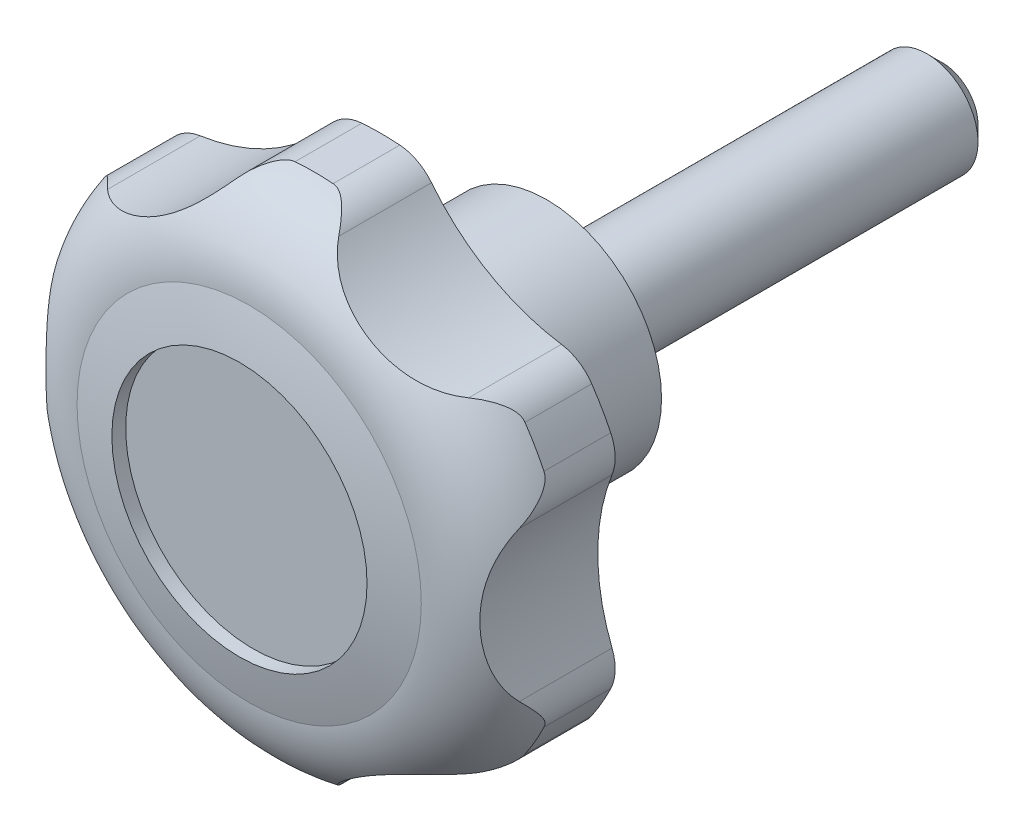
ISO-10303-21;
HEADER;
FILE_DESCRIPTION(('STEP AP214'),'2;1');
FILE_NAME('part.step','',(''),(''),'','','');
FILE_SCHEMA(('AUTOMOTIVE_DESIGN { 1 0 10303 214 1 1 1 1 }'));
ENDSEC;
DATA;
#1=APPLICATION_CONTEXT('core data for automotive mechanical design processes');
#2=APPLICATION_PROTOCOL_DEFINITION('international standard','automotive_design',2000,#1);
#3=PRODUCT_CONTEXT('',#1,'mechanical');
#4=PRODUCT('Part','Part','',(#3));
#5=PRODUCT_RELATED_PRODUCT_CATEGORY('part','',(#4));
#6=PRODUCT_DEFINITION_FORMATION('','',#4);
#7=PRODUCT_DEFINITION_CONTEXT('part definition',#1,'design');
#8=PRODUCT_DEFINITION('design','',#6,#7);
#9=PRODUCT_DEFINITION_SHAPE('','',#8);
#10=(LENGTH_UNIT() NAMED_UNIT(*) SI_UNIT(.MILLI.,.METRE.));
#11=(NAMED_UNIT(*) PLANE_ANGLE_UNIT() SI_UNIT($,.RADIAN.));
#12=(NAMED_UNIT(*) SI_UNIT($,.STERADIAN.) SOLID_ANGLE_UNIT());
#13=UNCERTAINTY_MEASURE_WITH_UNIT(LENGTH_MEASURE(1.E-05),#10,'distance_accuracy_value','');
#14=(GEOMETRIC_REPRESENTATION_CONTEXT(3) GLOBAL_UNCERTAINTY_ASSIGNED_CONTEXT((#13)) GLOBAL_UNIT_ASSIGNED_CONTEXT((#10,
#11,#12)) REPRESENTATION_CONTEXT('',''));
#15=CARTESIAN_POINT('',(0.,0.,0.));
#16=DIRECTION('',(0.,0.,1.));
#17=DIRECTION('',(1.,0.,0.));
#18=AXIS2_PLACEMENT_3D('',#15,#16,#17);
#19=CARTESIAN_POINT('',(0.,0.,-29.));
#20=DIRECTION('',(-1.,0.,0.));
#21=DIRECTION('',(0.,0.,-1.));
#22=AXIS2_PLACEMENT_3D('',#19,#20,#21);
#23=SPHERICAL_SURFACE('',#22,55.);
#24=CARTESIAN_POINT('',(0.,0.,-29.));
#25=DIRECTION('',(0.,0.,1.));
#26=DIRECTION('',(-1.,0.,0.));
#27=AXIS2_PLACEMENT_3D('',#24,#25,#26);
#28=SPHERICAL_SURFACE('',#27,55.);
#29=CARTESIAN_POINT('',(0.,0.,24.3198333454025));
#30=DIRECTION('',(0.,0.,1.));
#31=DIRECTION('',(-1.,0.,0.));
#32=AXIS2_PLACEMENT_3D('',#29,#30,#31);
#33=CIRCLE('',#32,13.4905660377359);
#34=CARTESIAN_POINT('',(-13.4905660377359,0.,24.3198333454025));
#35=VERTEX_POINT('',#34);
#36=EDGE_CURVE('E487',#35,#35,#33,.T.);
#37=ORIENTED_EDGE('',*,*,#36,.T.);
#38=EDGE_LOOP('',(#37));
#39=FACE_BOUND('',#38,.T.);
#40=CARTESIAN_POINT('',(0.,0.,25.0832691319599));
#41=DIRECTION('',(0.,0.,-1.));
#42=DIRECTION('',(1.,0.,0.));
#43=AXIS2_PLACEMENT_3D('',#40,#41,#42);
#44=CIRCLE('',#43,10.);
#45=CARTESIAN_POINT('',(10.,0.,25.0832691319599));
#46=VERTEX_POINT('',#45);
#47=EDGE_CURVE('E187',#46,#46,#44,.T.);
#48=ORIENTED_EDGE('',*,*,#47,.T.);
#49=EDGE_LOOP('',(#48));
#50=FACE_BOUND('',#49,.T.);
#51=ADVANCED_FACE('F14',(#39,#50),#28,.T.);
#52=CARTESIAN_POINT('',(0.,0.,30.5800521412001));
#53=DIRECTION('',(0.,0.,1.));
#54=DIRECTION('',(-1.,0.,0.));
#55=AXIS2_PLACEMENT_3D('',#52,#53,#54);
#56=CYLINDRICAL_SURFACE('',#55,20.);
#57=CARTESIAN_POINT('',(0.,0.,14.));
#58=DIRECTION('',(0.,0.,1.));
#59=DIRECTION('',(-1.,0.,0.));
#60=AXIS2_PLACEMENT_3D('',#57,#58,#59);
#61=CIRCLE('',#60,20.);
#62=CARTESIAN_POINT('',(1.4880574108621,19.9445653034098,14.));
#63=VERTEX_POINT('',#62);
#64=CARTESIAN_POINT('',(-1.48805741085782,19.94456530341,14.));
#65=VERTEX_POINT('',#64);
#66=EDGE_CURVE('E477',#63,#65,#61,.T.);
#67=ORIENTED_EDGE('',*,*,#66,.T.);
#68=DIRECTION('',(0.,0.,1.));
#69=VECTOR('',#68,1.);
#70=CARTESIAN_POINT('',(-1.48805741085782,19.94456530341,-29.));
#71=LINE('',#70,#69);
#72=CARTESIAN_POINT('',(-1.48805741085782,19.94456530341,19.231516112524));
#73=VERTEX_POINT('',#72);
#74=EDGE_CURVE('E178',#65,#73,#71,.T.);
#75=ORIENTED_EDGE('',*,*,#74,.T.);
#76=CARTESIAN_POINT('',(0.,0.,19.231516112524));
#77=DIRECTION('',(0.,0.,-1.));
#78=DIRECTION('',(1.,0.,0.));
#79=AXIS2_PLACEMENT_3D('',#76,#77,#78);
#80=CIRCLE('',#79,20.);
#81=CARTESIAN_POINT('',(1.4880574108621,19.9445653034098,19.231516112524));
#82=VERTEX_POINT('',#81);
#83=EDGE_CURVE('E193',#73,#82,#80,.T.);
#84=ORIENTED_EDGE('',*,*,#83,.T.);
#85=DIRECTION('',(0.,0.,1.));
#86=VECTOR('',#85,1.);
#87=CARTESIAN_POINT('',(1.4880574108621,19.9445653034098,-29.));
#88=LINE('',#87,#86);
#89=EDGE_CURVE('E647',#63,#82,#88,.T.);
#90=ORIENTED_EDGE('',*,*,#89,.F.);
#91=EDGE_LOOP('',(#67,#75,#84,#90));
#92=FACE_BOUND('',#91,.T.);
#93=ADVANCED_FACE('F443',(#92),#56,.T.);
#94=CARTESIAN_POINT('',(18.0165289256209,8.68358713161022,14.));
#95=VERTEX_POINT('',#94);
#96=CARTESIAN_POINT('',(16.5284715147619,11.2609781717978,14.));
#97=VERTEX_POINT('',#96);
#98=EDGE_CURVE('E481',#95,#97,#61,.T.);
#99=ORIENTED_EDGE('',*,*,#98,.T.);
#100=DIRECTION('',(0.,0.,1.));
#101=VECTOR('',#100,1.);
#102=CARTESIAN_POINT('',(16.5284715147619,11.2609781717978,-29.));
#103=LINE('',#102,#101);
#104=CARTESIAN_POINT('',(16.5284715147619,11.2609781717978,19.2315161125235));
#105=VERTEX_POINT('',#104);
#106=EDGE_CURVE('E505',#97,#105,#103,.T.);
#107=ORIENTED_EDGE('',*,*,#106,.T.);
#108=CARTESIAN_POINT('',(0.,0.,19.2315161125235));
#109=DIRECTION('',(0.,0.,-1.));
#110=DIRECTION('',(1.,0.,0.));
#111=AXIS2_PLACEMENT_3D('',#108,#109,#110);
#112=CIRCLE('',#111,20.);
#113=CARTESIAN_POINT('',(18.0165289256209,8.68358713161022,19.2315161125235));
#114=VERTEX_POINT('',#113);
#115=EDGE_CURVE('E369',#105,#114,#112,.T.);
#116=ORIENTED_EDGE('',*,*,#115,.T.);
#117=DIRECTION('',(0.,0.,1.));
#118=VECTOR('',#117,1.);
#119=CARTESIAN_POINT('',(18.0165289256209,8.68358713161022,-29.));
#120=LINE('',#119,#118);
#121=EDGE_CURVE('E508',#95,#114,#120,.T.);
#122=ORIENTED_EDGE('',*,*,#121,.F.);
#123=EDGE_LOOP('',(#99,#107,#116,#122));
#124=FACE_BOUND('',#123,.T.);
#125=ADVANCED_FACE('F445',(#124),#56,.T.);
#126=CARTESIAN_POINT('',(16.5284715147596,-11.260978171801,14.));
#127=VERTEX_POINT('',#126);
#128=CARTESIAN_POINT('',(18.0165289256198,-8.68358713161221,14.));
#129=VERTEX_POINT('',#128);
#130=EDGE_CURVE('E494',#127,#129,#61,.T.);
#131=ORIENTED_EDGE('',*,*,#130,.T.);
#132=DIRECTION('',(0.,0.,1.));
#133=VECTOR('',#132,1.);
#134=CARTESIAN_POINT('',(18.0165289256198,-8.68358713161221,-29.));
#135=LINE('',#134,#133);
#136=CARTESIAN_POINT('',(18.0165289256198,-8.68358713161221,19.2315161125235));
#137=VERTEX_POINT('',#136);
#138=EDGE_CURVE('E633',#129,#137,#135,.T.);
#139=ORIENTED_EDGE('',*,*,#138,.T.);
#140=CARTESIAN_POINT('',(0.,0.,19.2315161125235));
#141=DIRECTION('',(0.,0.,-1.));
#142=DIRECTION('',(1.,0.,0.));
#143=AXIS2_PLACEMENT_3D('',#140,#141,#142);
#144=CIRCLE('',#143,20.);
#145=CARTESIAN_POINT('',(16.5284715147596,-11.260978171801,19.2315161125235));
#146=VERTEX_POINT('',#145);
#147=EDGE_CURVE('E335',#137,#146,#144,.T.);
#148=ORIENTED_EDGE('',*,*,#147,.T.);
#149=DIRECTION('',(0.,0.,1.));
#150=VECTOR('',#149,1.);
#151=CARTESIAN_POINT('',(16.5284715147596,-11.260978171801,-29.));
#152=LINE('',#151,#150);
#153=EDGE_CURVE('E630',#127,#146,#152,.T.);
#154=ORIENTED_EDGE('',*,*,#153,.F.);
#155=EDGE_LOOP('',(#131,#139,#148,#154));
#156=FACE_BOUND('',#155,.T.);
#157=ADVANCED_FACE('F453',(#156),#56,.T.);
#158=CARTESIAN_POINT('',(-1.48805741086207,-19.9445653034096,14.));
#159=VERTEX_POINT('',#158);
#160=CARTESIAN_POINT('',(1.48805741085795,-19.94456530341,14.));
#161=VERTEX_POINT('',#160);
#162=EDGE_CURVE('E488',#159,#161,#61,.T.);
#163=ORIENTED_EDGE('',*,*,#162,.T.);
#164=DIRECTION('',(0.,0.,1.));
#165=VECTOR('',#164,1.);
#166=CARTESIAN_POINT('',(1.48805741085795,-19.94456530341,-29.));
#167=LINE('',#166,#165);
#168=CARTESIAN_POINT('',(1.48805741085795,-19.94456530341,19.231516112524));
#169=VERTEX_POINT('',#168);
#170=EDGE_CURVE('E622',#161,#169,#167,.T.);
#171=ORIENTED_EDGE('',*,*,#170,.T.);
#172=CARTESIAN_POINT('',(0.,0.,19.231516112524));
#173=DIRECTION('',(0.,0.,-1.));
#174=DIRECTION('',(1.,0.,0.));
#175=AXIS2_PLACEMENT_3D('',#172,#173,#174);
#176=CIRCLE('',#175,20.);
#177=CARTESIAN_POINT('',(-1.48805741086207,-19.9445653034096,19.231516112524));
#178=VERTEX_POINT('',#177);
#179=EDGE_CURVE('E322',#169,#178,#176,.T.);
#180=ORIENTED_EDGE('',*,*,#179,.T.);
#181=DIRECTION('',(0.,0.,1.));
#182=VECTOR('',#181,1.);
#183=CARTESIAN_POINT('',(-1.48805741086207,-19.9445653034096,-29.));
#184=LINE('',#183,#182);
#185=EDGE_CURVE('E619',#159,#178,#184,.T.);
#186=ORIENTED_EDGE('',*,*,#185,.F.);
#187=EDGE_LOOP('',(#163,#171,#180,#186));
#188=FACE_BOUND('',#187,.T.);
#189=ADVANCED_FACE('F464',(#188),#56,.T.);
#190=CARTESIAN_POINT('',(-18.0165289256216,-8.68358713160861,14.));
#191=VERTEX_POINT('',#190);
#192=CARTESIAN_POINT('',(-16.5284715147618,-11.2609781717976,14.));
#193=VERTEX_POINT('',#192);
#194=EDGE_CURVE('E480',#191,#193,#61,.T.);
#195=ORIENTED_EDGE('',*,*,#194,.T.);
#196=DIRECTION('',(0.,0.,1.));
#197=VECTOR('',#196,1.);
#198=CARTESIAN_POINT('',(-16.5284715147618,-11.2609781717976,-29.));
#199=LINE('',#198,#197);
#200=CARTESIAN_POINT('',(-16.5284715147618,-11.2609781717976,19.231516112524));
#201=VERTEX_POINT('',#200);
#202=EDGE_CURVE('E611',#193,#201,#199,.T.);
#203=ORIENTED_EDGE('',*,*,#202,.T.);
#204=CARTESIAN_POINT('',(0.,0.,19.231516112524));
#205=DIRECTION('',(0.,0.,-1.));
#206=DIRECTION('',(1.,0.,0.));
#207=AXIS2_PLACEMENT_3D('',#204,#205,#206);
#208=CIRCLE('',#207,20.);
#209=CARTESIAN_POINT('',(-18.0165289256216,-8.68358713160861,19.231516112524));
#210=VERTEX_POINT('',#209);
#211=EDGE_CURVE('E275',#201,#210,#208,.T.);
#212=ORIENTED_EDGE('',*,*,#211,.T.);
#213=DIRECTION('',(0.,0.,1.));
#214=VECTOR('',#213,1.);
#215=CARTESIAN_POINT('',(-18.0165289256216,-8.68358713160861,-29.));
#216=LINE('',#215,#214);
#217=EDGE_CURVE('E608',#191,#210,#216,.T.);
#218=ORIENTED_EDGE('',*,*,#217,.F.);
#219=EDGE_LOOP('',(#195,#203,#212,#218));
#220=FACE_BOUND('',#219,.T.);
#221=ADVANCED_FACE('F458',(#220),#56,.T.);
#222=CARTESIAN_POINT('',(-16.5284715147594,11.2609781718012,14.));
#223=VERTEX_POINT('',#222);
#224=CARTESIAN_POINT('',(-18.0165289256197,8.68358713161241,14.));
#225=VERTEX_POINT('',#224);
#226=EDGE_CURVE('E469',#223,#225,#61,.T.);
#227=ORIENTED_EDGE('',*,*,#226,.T.);
#228=DIRECTION('',(0.,0.,1.));
#229=VECTOR('',#228,1.);
#230=CARTESIAN_POINT('',(-18.0165289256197,8.68358713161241,-29.));
#231=LINE('',#230,#229);
#232=CARTESIAN_POINT('',(-18.0165289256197,8.68358713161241,19.231516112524));
#233=VERTEX_POINT('',#232);
#234=EDGE_CURVE('E470',#225,#233,#231,.T.);
#235=ORIENTED_EDGE('',*,*,#234,.T.);
#236=CARTESIAN_POINT('',(0.,0.,19.231516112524));
#237=DIRECTION('',(0.,0.,-1.));
#238=DIRECTION('',(1.,0.,0.));
#239=AXIS2_PLACEMENT_3D('',#236,#237,#238);
#240=CIRCLE('',#239,20.);
#241=CARTESIAN_POINT('',(-16.5284715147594,11.2609781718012,19.231516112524));
#242=VERTEX_POINT('',#241);
#243=EDGE_CURVE('E237',#233,#242,#240,.T.);
#244=ORIENTED_EDGE('',*,*,#243,.T.);
#245=DIRECTION('',(0.,0.,1.));
#246=VECTOR('',#245,1.);
#247=CARTESIAN_POINT('',(-16.5284715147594,11.2609781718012,-29.));
#248=LINE('',#247,#246);
#249=EDGE_CURVE('E473',#223,#242,#248,.T.);
#250=ORIENTED_EDGE('',*,*,#249,.F.);
#251=EDGE_LOOP('',(#227,#235,#244,#250));
#252=FACE_BOUND('',#251,.T.);
#253=ADVANCED_FACE('F441',(#252),#56,.T.);
#254=CARTESIAN_POINT('',(0.,9.,14.));
#255=DIRECTION('',(0.,0.,1.));
#256=DIRECTION('',(-1.,0.,0.));
#257=AXIS2_PLACEMENT_3D('',#254,#255,#256);
#258=PLANE('',#257);
#259=ORIENTED_EDGE('',*,*,#66,.F.);
#260=CARTESIAN_POINT('',(1.22764736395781,16.4542663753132,14.));
#261=DIRECTION('',(0.,0.,1.));
#262=DIRECTION('',(-1.,0.,0.));
#263=AXIS2_PLACEMENT_3D('',#260,#261,#262);
#264=CIRCLE('',#263,3.5);
#265=CARTESIAN_POINT('',(3.96883886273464,18.6304715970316,14.));
#266=VERTEX_POINT('',#265);
#267=EDGE_CURVE('E523',#63,#266,#264,.F.);
#268=ORIENTED_EDGE('',*,*,#267,.T.);
#269=CARTESIAN_POINT('',(16.5,28.5788383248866,14.));
#270=DIRECTION('',(0.,0.,1.));
#271=DIRECTION('',(-1.,0.,0.));
#272=AXIS2_PLACEMENT_3D('',#269,#270,#271);
#273=CIRCLE('',#272,16.);
#274=CARTESIAN_POINT('',(14.1500422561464,12.752351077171,14.));
#275=VERTEX_POINT('',#274);
#276=EDGE_CURVE('E519',#275,#266,#273,.F.);
#277=ORIENTED_EDGE('',*,*,#276,.F.);
#278=CARTESIAN_POINT('',(13.6359889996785,9.290306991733,14.));
#279=DIRECTION('',(0.,0.,1.));
#280=DIRECTION('',(-1.,0.,0.));
#281=AXIS2_PLACEMENT_3D('',#278,#279,#280);
#282=CIRCLE('',#281,3.5);
#283=EDGE_CURVE('E517',#275,#97,#282,.F.);
#284=ORIENTED_EDGE('',*,*,#283,.T.);
#285=ORIENTED_EDGE('',*,*,#98,.F.);
#286=CARTESIAN_POINT('',(14.8636363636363,7.16395938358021,14.));
#287=DIRECTION('',(0.,0.,1.));
#288=DIRECTION('',(-1.,0.,0.));
#289=AXIS2_PLACEMENT_3D('',#286,#287,#288);
#290=CIRCLE('',#289,3.5);
#291=CARTESIAN_POINT('',(18.118881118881,5.87812051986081,14.));
#292=VERTEX_POINT('',#291);
#293=EDGE_CURVE('E515',#95,#292,#290,.F.);
#294=ORIENTED_EDGE('',*,*,#293,.T.);
#295=CARTESIAN_POINT('',(33.,0.,14.));
#296=DIRECTION('',(0.,0.,1.));
#297=DIRECTION('',(-1.,0.,0.));
#298=AXIS2_PLACEMENT_3D('',#295,#296,#297);
#299=CIRCLE('',#298,16.);
#300=CARTESIAN_POINT('',(18.1188811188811,-5.87812051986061,14.));
#301=VERTEX_POINT('',#300);
#302=EDGE_CURVE('E525',#301,#292,#299,.F.);
#303=ORIENTED_EDGE('',*,*,#302,.F.);
#304=CARTESIAN_POINT('',(14.8636363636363,-7.16395938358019,14.));
#305=DIRECTION('',(0.,0.,1.));
#306=DIRECTION('',(-1.,0.,0.));
#307=AXIS2_PLACEMENT_3D('',#304,#305,#306);
#308=CIRCLE('',#307,3.5);
#309=EDGE_CURVE('E678',#301,#129,#308,.F.);
#310=ORIENTED_EDGE('',*,*,#309,.T.);
#311=ORIENTED_EDGE('',*,*,#130,.F.);
#312=CARTESIAN_POINT('',(13.6359889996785,-9.290306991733,14.));
#313=DIRECTION('',(0.,0.,1.));
#314=DIRECTION('',(-1.,0.,0.));
#315=AXIS2_PLACEMENT_3D('',#312,#313,#314);
#316=CIRCLE('',#315,3.5);
#317=CARTESIAN_POINT('',(14.1500422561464,-12.7523510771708,14.));
#318=VERTEX_POINT('',#317);
#319=EDGE_CURVE('E675',#127,#318,#316,.F.);
#320=ORIENTED_EDGE('',*,*,#319,.T.);
#321=CARTESIAN_POINT('',(16.5,-28.5788383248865,14.));
#322=DIRECTION('',(0.,0.,1.));
#323=DIRECTION('',(-1.,0.,0.));
#324=AXIS2_PLACEMENT_3D('',#321,#322,#323);
#325=CIRCLE('',#324,16.);
#326=CARTESIAN_POINT('',(3.96883886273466,-18.6304715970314,14.));
#327=VERTEX_POINT('',#326);
#328=EDGE_CURVE('E673',#327,#318,#325,.F.);
#329=ORIENTED_EDGE('',*,*,#328,.F.);
#330=CARTESIAN_POINT('',(1.22764736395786,-16.4542663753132,14.));
#331=DIRECTION('',(0.,0.,1.));
#332=DIRECTION('',(-1.,0.,0.));
#333=AXIS2_PLACEMENT_3D('',#330,#331,#332);
#334=CIRCLE('',#333,3.5);
#335=EDGE_CURVE('E670',#327,#161,#334,.F.);
#336=ORIENTED_EDGE('',*,*,#335,.T.);
#337=ORIENTED_EDGE('',*,*,#162,.F.);
#338=CARTESIAN_POINT('',(-1.22764736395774,-16.4542663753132,14.));
#339=DIRECTION('',(0.,0.,1.));
#340=DIRECTION('',(-1.,0.,0.));
#341=AXIS2_PLACEMENT_3D('',#338,#339,#340);
#342=CIRCLE('',#341,3.5);
#343=CARTESIAN_POINT('',(-3.96883886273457,-18.6304715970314,14.));
#344=VERTEX_POINT('',#343);
#345=EDGE_CURVE('E667',#159,#344,#342,.F.);
#346=ORIENTED_EDGE('',*,*,#345,.T.);
#347=CARTESIAN_POINT('',(-16.5,-28.5788383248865,14.));
#348=DIRECTION('',(0.,0.,1.));
#349=DIRECTION('',(-1.,0.,0.));
#350=AXIS2_PLACEMENT_3D('',#347,#348,#349);
#351=CIRCLE('',#350,16.);
#352=CARTESIAN_POINT('',(-14.1500422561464,-12.7523510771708,14.));
#353=VERTEX_POINT('',#352);
#354=EDGE_CURVE('E665',#353,#344,#351,.F.);
#355=ORIENTED_EDGE('',*,*,#354,.F.);
#356=CARTESIAN_POINT('',(-13.6359889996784,-9.290306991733,14.));
#357=DIRECTION('',(0.,0.,1.));
#358=DIRECTION('',(-1.,0.,0.));
#359=AXIS2_PLACEMENT_3D('',#356,#357,#358);
#360=CIRCLE('',#359,3.5);
#361=EDGE_CURVE('E662',#353,#193,#360,.F.);
#362=ORIENTED_EDGE('',*,*,#361,.T.);
#363=ORIENTED_EDGE('',*,*,#194,.F.);
#364=CARTESIAN_POINT('',(-14.8636363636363,-7.16395938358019,14.));
#365=DIRECTION('',(0.,0.,1.));
#366=DIRECTION('',(-1.,0.,0.));
#367=AXIS2_PLACEMENT_3D('',#364,#365,#366);
#368=CIRCLE('',#367,3.5);
#369=CARTESIAN_POINT('',(-18.1188811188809,-5.87812051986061,14.));
#370=VERTEX_POINT('',#369);
#371=EDGE_CURVE('E659',#191,#370,#368,.F.);
#372=ORIENTED_EDGE('',*,*,#371,.T.);
#373=CARTESIAN_POINT('',(-33.,0.,14.));
#374=DIRECTION('',(0.,0.,1.));
#375=DIRECTION('',(-1.,0.,0.));
#376=AXIS2_PLACEMENT_3D('',#373,#374,#375);
#377=CIRCLE('',#376,16.);
#378=CARTESIAN_POINT('',(-18.1188811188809,5.87812051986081,14.));
#379=VERTEX_POINT('',#378);
#380=EDGE_CURVE('E653',#379,#370,#377,.F.);
#381=ORIENTED_EDGE('',*,*,#380,.F.);
#382=CARTESIAN_POINT('',(-14.8636363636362,7.16395938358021,14.));
#383=DIRECTION('',(0.,0.,1.));
#384=DIRECTION('',(-1.,0.,0.));
#385=AXIS2_PLACEMENT_3D('',#382,#383,#384);
#386=CIRCLE('',#385,3.5);
#387=EDGE_CURVE('E650',#379,#225,#386,.F.);
#388=ORIENTED_EDGE('',*,*,#387,.T.);
#389=ORIENTED_EDGE('',*,*,#226,.F.);
#390=CARTESIAN_POINT('',(-13.6359889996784,9.290306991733,14.));
#391=DIRECTION('',(0.,0.,1.));
#392=DIRECTION('',(-1.,0.,0.));
#393=AXIS2_PLACEMENT_3D('',#390,#391,#392);
#394=CIRCLE('',#393,3.5);
#395=CARTESIAN_POINT('',(-14.1500422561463,12.752351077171,14.));
#396=VERTEX_POINT('',#395);
#397=EDGE_CURVE('E651',#223,#396,#394,.F.);
#398=ORIENTED_EDGE('',*,*,#397,.T.);
#399=CARTESIAN_POINT('',(-16.5,28.5788383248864,14.));
#400=DIRECTION('',(0.,0.,1.));
#401=DIRECTION('',(-1.,0.,0.));
#402=AXIS2_PLACEMENT_3D('',#399,#400,#401);
#403=CIRCLE('',#402,16.);
#404=CARTESIAN_POINT('',(-3.96883886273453,18.6304715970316,14.));
#405=VERTEX_POINT('',#404);
#406=EDGE_CURVE('E492',#405,#396,#403,.F.);
#407=ORIENTED_EDGE('',*,*,#406,.F.);
#408=CARTESIAN_POINT('',(-1.22764736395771,16.4542663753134,14.));
#409=DIRECTION('',(0.,0.,1.));
#410=DIRECTION('',(-1.,0.,0.));
#411=AXIS2_PLACEMENT_3D('',#408,#409,#410);
#412=CIRCLE('',#411,3.5);
#413=EDGE_CURVE('E185',#405,#65,#412,.F.);
#414=ORIENTED_EDGE('',*,*,#413,.T.);
#415=EDGE_LOOP('',(#259,#268,#277,#284,#285,#294,#303,#310,#311,#320,#329,#336,#337,#346,#355,
#362,#363,#372,#381,#388,#389,#398,#407,#414));
#416=FACE_BOUND('',#415,.T.);
#417=CARTESIAN_POINT('',(0.,0.,14.));
#418=DIRECTION('',(0.,0.,1.));
#419=DIRECTION('',(-1.,0.,0.));
#420=AXIS2_PLACEMENT_3D('',#417,#418,#419);
#421=CIRCLE('',#420,9.);
#422=CARTESIAN_POINT('',(-9.,0.,14.));
#423=VERTEX_POINT('',#422);
#424=EDGE_CURVE('E478',#423,#423,#421,.T.);
#425=ORIENTED_EDGE('',*,*,#424,.T.);
#426=EDGE_LOOP('',(#425));
#427=FACE_BOUND('',#426,.T.);
#428=ADVANCED_FACE('F438',(#416,#427),#258,.F.);
#429=CARTESIAN_POINT('',(0.,0.,30.5800521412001));
#430=DIRECTION('',(0.,0.,1.));
#431=DIRECTION('',(-1.,0.,0.));
#432=AXIS2_PLACEMENT_3D('',#429,#430,#431);
#433=CYLINDRICAL_SURFACE('',#432,9.);
#434=CARTESIAN_POINT('',(0.,0.,1.));
#435=DIRECTION('',(0.,0.,1.));
#436=DIRECTION('',(-1.,0.,0.));
#437=AXIS2_PLACEMENT_3D('',#434,#435,#436);
#438=CIRCLE('',#437,9.);
#439=CARTESIAN_POINT('',(-9.,0.,1.));
#440=VERTEX_POINT('',#439);
#441=EDGE_CURVE('E483',#440,#440,#438,.T.);
#442=ORIENTED_EDGE('',*,*,#441,.T.);
#443=EDGE_LOOP('',(#442));
#444=FACE_BOUND('',#443,.T.);
#445=ORIENTED_EDGE('',*,*,#424,.F.);
#446=EDGE_LOOP('',(#445));
#447=FACE_BOUND('',#446,.T.);
#448=ADVANCED_FACE('F434',(#444,#447),#433,.T.);
#449=CARTESIAN_POINT('',(0.,9.,1.));
#450=DIRECTION('',(0.,0.,-1.));
#451=DIRECTION('',(1.,0.,0.));
#452=AXIS2_PLACEMENT_3D('',#449,#450,#451);
#453=PLANE('',#452);
#454=CARTESIAN_POINT('',(0.,0.,1.));
#455=DIRECTION('',(0.,0.,1.));
#456=DIRECTION('',(-1.,0.,0.));
#457=AXIS2_PLACEMENT_3D('',#454,#455,#456);
#458=CIRCLE('',#457,7.);
#459=CARTESIAN_POINT('',(-7.,0.,1.));
#460=VERTEX_POINT('',#459);
#461=EDGE_CURVE('E565',#460,#460,#458,.T.);
#462=ORIENTED_EDGE('',*,*,#461,.T.);
#463=EDGE_LOOP('',(#462));
#464=FACE_BOUND('',#463,.T.);
#465=ORIENTED_EDGE('',*,*,#441,.F.);
#466=EDGE_LOOP('',(#465));
#467=FACE_BOUND('',#466,.T.);
#468=ADVANCED_FACE('F430',(#464,#467),#453,.T.);
#469=CARTESIAN_POINT('',(0.,0.,30.5800521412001));
#470=DIRECTION('',(0.,0.,1.));
#471=DIRECTION('',(-1.,0.,0.));
#472=AXIS2_PLACEMENT_3D('',#469,#470,#471);
#473=CYLINDRICAL_SURFACE('',#472,7.);
#474=CARTESIAN_POINT('',(0.,0.,0.));
#475=DIRECTION('',(0.,0.,1.));
#476=DIRECTION('',(-1.,0.,0.));
#477=AXIS2_PLACEMENT_3D('',#474,#475,#476);
#478=CIRCLE('',#477,7.);
#479=CARTESIAN_POINT('',(-7.,0.,0.));
#480=VERTEX_POINT('',#479);
#481=EDGE_CURVE('E562',#480,#480,#478,.T.);
#482=ORIENTED_EDGE('',*,*,#481,.T.);
#483=EDGE_LOOP('',(#482));
#484=FACE_BOUND('',#483,.T.);
#485=ORIENTED_EDGE('',*,*,#461,.F.);
#486=EDGE_LOOP('',(#485));
#487=FACE_BOUND('',#486,.T.);
#488=ADVANCED_FACE('F426',(#484,#487),#473,.T.);
#489=CARTESIAN_POINT('',(0.,3.6,0.));
#490=DIRECTION('',(0.,0.,1.));
#491=DIRECTION('',(-1.,0.,0.));
#492=AXIS2_PLACEMENT_3D('',#489,#490,#491);
#493=PLANE('',#492);
#494=ORIENTED_EDGE('',*,*,#481,.F.);
#495=EDGE_LOOP('',(#494));
#496=FACE_BOUND('',#495,.T.);
#497=CARTESIAN_POINT('',(0.,0.,0.));
#498=DIRECTION('',(0.,0.,1.));
#499=DIRECTION('',(-1.,0.,0.));
#500=AXIS2_PLACEMENT_3D('',#497,#498,#499);
#501=CIRCLE('',#500,3.59999999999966);
#502=CARTESIAN_POINT('',(-3.59999999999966,0.,0.));
#503=VERTEX_POINT('',#502);
#504=EDGE_CURVE('E559',#503,#503,#501,.T.);
#505=ORIENTED_EDGE('',*,*,#504,.T.);
#506=EDGE_LOOP('',(#505));
#507=FACE_BOUND('',#506,.T.);
#508=ADVANCED_FACE('F422',(#496,#507),#493,.F.);
#509=CARTESIAN_POINT('',(0.,0.,-0.600000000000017));
#510=DIRECTION('',(0.,0.,1.));
#511=DIRECTION('',(-1.,0.,0.));
#512=AXIS2_PLACEMENT_3D('',#509,#510,#511);
#513=TOROIDAL_SURFACE('',#512,3.59999999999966,0.599999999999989);
#514=ORIENTED_EDGE('',*,*,#504,.F.);
#515=EDGE_LOOP('',(#514));
#516=FACE_BOUND('',#515,.T.);
#517=CARTESIAN_POINT('',(0.,0.,-0.600000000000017));
#518=DIRECTION('',(0.,0.,1.));
#519=DIRECTION('',(-1.,0.,0.));
#520=AXIS2_PLACEMENT_3D('',#517,#518,#519);
#521=CIRCLE('',#520,2.99999999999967);
#522=CARTESIAN_POINT('',(-2.99999999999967,0.,-0.600000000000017));
#523=VERTEX_POINT('',#522);
#524=EDGE_CURVE('E554',#523,#523,#521,.T.);
#525=ORIENTED_EDGE('',*,*,#524,.T.);
#526=EDGE_LOOP('',(#525));
#527=FACE_BOUND('',#526,.T.);
#528=ADVANCED_FACE('F418',(#516,#527),#513,.F.);
#529=CARTESIAN_POINT('',(0.,0.,30.5800521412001));
#530=DIRECTION('',(0.,0.,1.));
#531=DIRECTION('',(-1.,0.,0.));
#532=AXIS2_PLACEMENT_3D('',#529,#530,#531);
#533=CYLINDRICAL_SURFACE('',#532,2.99999999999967);
#534=CARTESIAN_POINT('',(0.,0.,-1.9));
#535=DIRECTION('',(0.,0.,1.));
#536=DIRECTION('',(-1.,0.,0.));
#537=AXIS2_PLACEMENT_3D('',#534,#535,#536);
#538=CIRCLE('',#537,2.99999999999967);
#539=CARTESIAN_POINT('',(-2.99999999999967,0.,-1.9));
#540=VERTEX_POINT('',#539);
#541=EDGE_CURVE('E552',#540,#540,#538,.T.);
#542=ORIENTED_EDGE('',*,*,#541,.T.);
#543=EDGE_LOOP('',(#542));
#544=FACE_BOUND('',#543,.T.);
#545=ORIENTED_EDGE('',*,*,#524,.F.);
#546=EDGE_LOOP('',(#545));
#547=FACE_BOUND('',#546,.T.);
#548=ADVANCED_FACE('F414',(#544,#547),#533,.T.);
#549=CARTESIAN_POINT('',(0.,0.,-1.9));
#550=DIRECTION('',(0.,0.,1.));
#551=DIRECTION('',(-1.,0.,0.));
#552=AXIS2_PLACEMENT_3D('',#549,#550,#551);
#553=TOROIDAL_SURFACE('',#552,3.59999999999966,0.599999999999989);
#554=ORIENTED_EDGE('',*,*,#541,.F.);
#555=EDGE_LOOP('',(#554));
#556=FACE_BOUND('',#555,.T.);
#557=CARTESIAN_POINT('',(0.,0.,-2.5));
#558=DIRECTION('',(0.,0.,1.));
#559=DIRECTION('',(-1.,0.,0.));
#560=AXIS2_PLACEMENT_3D('',#557,#558,#559);
#561=CIRCLE('',#560,3.59999999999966);
#562=CARTESIAN_POINT('',(-3.59999999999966,0.,-2.5));
#563=VERTEX_POINT('',#562);
#564=EDGE_CURVE('E197',#563,#563,#561,.T.);
#565=ORIENTED_EDGE('',*,*,#564,.T.);
#566=EDGE_LOOP('',(#565));
#567=FACE_BOUND('',#566,.T.);
#568=ADVANCED_FACE('F410',(#556,#567),#553,.F.);
#569=CARTESIAN_POINT('',(0.,3.6,-2.5));
#570=DIRECTION('',(0.,0.,1.));
#571=DIRECTION('',(-1.,0.,0.));
#572=AXIS2_PLACEMENT_3D('',#569,#570,#571);
#573=PLANE('',#572);
#574=CARTESIAN_POINT('',(0.,0.,-2.5));
#575=DIRECTION('',(0.,0.,1.));
#576=DIRECTION('',(-1.,0.,0.));
#577=AXIS2_PLACEMENT_3D('',#574,#575,#576);
#578=CIRCLE('',#577,4.);
#579=CARTESIAN_POINT('',(-4.,0.,-2.5));
#580=VERTEX_POINT('',#579);
#581=EDGE_CURVE('E194',#580,#580,#578,.T.);
#582=ORIENTED_EDGE('',*,*,#581,.T.);
#583=EDGE_LOOP('',(#582));
#584=FACE_BOUND('',#583,.T.);
#585=ORIENTED_EDGE('',*,*,#564,.F.);
#586=EDGE_LOOP('',(#585));
#587=FACE_BOUND('',#586,.T.);
#588=ADVANCED_FACE('F406',(#584,#587),#573,.T.);
#589=CARTESIAN_POINT('',(0.,0.,30.5800521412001));
#590=DIRECTION('',(0.,0.,1.));
#591=DIRECTION('',(-1.,0.,0.));
#592=AXIS2_PLACEMENT_3D('',#589,#590,#591);
#593=CYLINDRICAL_SURFACE('',#592,4.);
#594=CARTESIAN_POINT('',(0.,0.,-28.8));
#595=DIRECTION('',(0.,0.,-1.));
#596=DIRECTION('',(-1.,0.,0.));
#597=AXIS2_PLACEMENT_3D('',#594,#595,#596);
#598=CIRCLE('',#597,4.);
#599=CARTESIAN_POINT('',(-4.,0.,-28.8));
#600=VERTEX_POINT('',#599);
#601=EDGE_CURVE('E9',#600,#600,#598,.F.);
#602=ORIENTED_EDGE('',*,*,#601,.T.);
#603=EDGE_LOOP('',(#602));
#604=FACE_BOUND('',#603,.T.);
#605=ORIENTED_EDGE('',*,*,#581,.F.);
#606=EDGE_LOOP('',(#605));
#607=FACE_BOUND('',#606,.T.);
#608=ADVANCED_FACE('F216',(#604,#607),#593,.T.);
#609=CARTESIAN_POINT('',(-1.22764736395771,16.4542663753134,-29.));
#610=DIRECTION('',(0.,0.,1.));
#611=DIRECTION('',(-1.,0.,0.));
#612=AXIS2_PLACEMENT_3D('',#609,#610,#611);
#613=CYLINDRICAL_SURFACE('',#612,3.5);
#614=CARTESIAN_POINT('',(-3.96899762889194,18.6302715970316,21.267261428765));
#615=CARTESIAN_POINT('',(-3.9019400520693,18.7146904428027,21.1666942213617));
#616=CARTESIAN_POINT('',(-3.83132679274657,18.7956967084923,21.0656326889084));
#617=CARTESIAN_POINT('',(-3.68293630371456,18.9508975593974,20.8632604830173));
#618=CARTESIAN_POINT('',(-3.60514991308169,19.0250831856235,20.7619496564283));
#619=CARTESIAN_POINT('',(-3.44241757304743,19.1665387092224,20.5599382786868));
#620=CARTESIAN_POINT('',(-3.35746148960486,19.2337985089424,20.4592388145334));
#621=CARTESIAN_POINT('',(-3.18011140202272,19.3611219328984,20.2599728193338));
#622=CARTESIAN_POINT('',(-3.0877228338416,19.4211907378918,20.1614047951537));
#623=CARTESIAN_POINT('',(-2.90695324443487,19.5266292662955,19.9810233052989));
#624=CARTESIAN_POINT('',(-2.81961059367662,19.5728947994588,19.898696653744));
#625=CARTESIAN_POINT('',(-2.63679974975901,19.6596639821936,19.7394680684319));
#626=CARTESIAN_POINT('',(-2.54131034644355,19.7001518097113,19.662581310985));
#627=CARTESIAN_POINT('',(-2.35756826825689,19.7680484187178,19.5316420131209));
#628=CARTESIAN_POINT('',(-2.27090694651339,19.7965086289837,19.4759381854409));
#629=CARTESIAN_POINT('',(-2.0897395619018,19.8477227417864,19.3771758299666));
#630=CARTESIAN_POINT('',(-1.99531126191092,19.8705257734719,19.3340078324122));
#631=CARTESIAN_POINT('',(-1.83189250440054,19.9023409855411,19.2791482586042));
#632=CARTESIAN_POINT('',(-1.76529669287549,19.9134001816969,19.2617384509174));
#633=CARTESIAN_POINT('',(-1.66304497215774,19.9272537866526,19.2438423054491));
#634=CARTESIAN_POINT('',(-1.62828042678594,19.9314379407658,19.2392438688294));
#635=CARTESIAN_POINT('',(-1.55831752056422,19.9387896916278,19.2330659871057));
#636=CARTESIAN_POINT('',(-1.52311850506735,19.9419554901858,19.2314918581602));
#637=CARTESIAN_POINT('',(-1.48785741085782,19.9445802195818,19.2315161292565));
#638=B_SPLINE_CURVE_WITH_KNOTS('',3,(#614,#615,#616,#617,#618,#619,#620,#621,#622,#623,#624,
#625,#626,#627,#628,#629,#630,#631,#632,#633,#634,#635,#636,#637),.UNSPECIFIED.,.F.,.F.,(4,2,2,
2,2,2,2,2,2,2,2,4),(0.,0.44222286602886,0.885018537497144,1.32845091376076,1.77156187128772,
2.15711304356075,2.54370056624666,2.8636275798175,3.18067046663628,3.38888363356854,
3.49469598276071,3.60069416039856),.UNSPECIFIED.);
#639=CARTESIAN_POINT('',(-3.96883886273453,18.6304715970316,21.2670230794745));
#640=VERTEX_POINT('',#639);
#641=EDGE_CURVE('E182',#640,#73,#638,.T.);
#642=ORIENTED_EDGE('',*,*,#641,.T.);
#643=ORIENTED_EDGE('',*,*,#74,.F.);
#644=ORIENTED_EDGE('',*,*,#413,.F.);
#645=DIRECTION('',(0.,0.,1.));
#646=VECTOR('',#645,1.);
#647=CARTESIAN_POINT('',(-3.96883886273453,18.6304715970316,-29.));
#648=LINE('',#647,#646);
#649=EDGE_CURVE('E34',#405,#640,#648,.T.);
#650=ORIENTED_EDGE('',*,*,#649,.T.);
#651=EDGE_LOOP('',(#642,#643,#644,#650));
#652=FACE_BOUND('',#651,.T.);
#653=ADVANCED_FACE('F181',(#652),#613,.T.);
#654=CARTESIAN_POINT('',(1.22764736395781,16.4542663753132,-29.));
#655=DIRECTION('',(0.,0.,1.));
#656=DIRECTION('',(-1.,0.,0.));
#657=AXIS2_PLACEMENT_3D('',#654,#655,#656);
#658=CYLINDRICAL_SURFACE('',#657,3.5);
#659=CARTESIAN_POINT('',(1.4878574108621,19.9445802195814,19.2315161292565));
#660=CARTESIAN_POINT('',(1.52919036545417,19.9415064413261,19.2314743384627));
#661=CARTESIAN_POINT('',(1.57042804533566,19.9376858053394,19.2336479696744));
#662=CARTESIAN_POINT('',(1.65220873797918,19.9286617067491,19.2421108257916));
#663=CARTESIAN_POINT('',(1.69275341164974,19.9234622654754,19.2483881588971));
#664=CARTESIAN_POINT('',(1.81124023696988,19.9061776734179,19.2725758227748));
#665=CARTESIAN_POINT('',(1.88782949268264,19.8922655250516,19.2958697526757));
#666=CARTESIAN_POINT('',(2.06808982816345,19.8536100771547,19.365456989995));
#667=CARTESIAN_POINT('',(2.16903615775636,19.8267881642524,19.4173481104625));
#668=CARTESIAN_POINT('',(2.36240281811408,19.7667746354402,19.5338897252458));
#669=CARTESIAN_POINT('',(2.45470904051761,19.7335118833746,19.5986829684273));
#670=CARTESIAN_POINT('',(2.64020654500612,19.6582672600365,19.7418693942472));
#671=CARTESIAN_POINT('',(2.73262242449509,19.6157535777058,19.8209716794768));
#672=CARTESIAN_POINT('',(2.91022815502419,19.5249126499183,19.983911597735));
#673=CARTESIAN_POINT('',(2.9954097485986,19.4765789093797,20.0677544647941));
#674=CARTESIAN_POINT('',(3.15938772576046,19.3744852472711,20.2378736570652));
#675=CARTESIAN_POINT('',(3.238197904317,19.3207376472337,20.3241441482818));
#676=CARTESIAN_POINT('',(3.39023180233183,19.2078435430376,20.4980731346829));
#677=CARTESIAN_POINT('',(3.46345465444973,19.1486962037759,20.585731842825));
#678=CARTESIAN_POINT('',(3.61341175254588,19.0173280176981,20.7726217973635));
#679=CARTESIAN_POINT('',(3.68943499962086,18.9443978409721,20.8719258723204));
#680=CARTESIAN_POINT('',(3.83442498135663,18.79214141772,21.0700645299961));
#681=CARTESIAN_POINT('',(3.90341485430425,18.7128377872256,21.1688995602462));
#682=CARTESIAN_POINT('',(3.96899762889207,18.6302715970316,21.267261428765));
#683=B_SPLINE_CURVE_WITH_KNOTS('',3,(#659,#660,#661,#662,#663,#664,#665,#666,#667,#668,#669,
#670,#671,#672,#673,#674,#675,#676,#677,#678,#679,#680,#681,#682),.UNSPECIFIED.,.F.,.F.,(4,2,2,
2,2,2,2,2,2,2,2,4),(0.,0.124209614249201,0.248060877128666,0.490467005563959,0.838397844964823,
1.19041658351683,1.57643074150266,1.9628797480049,2.34846828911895,2.7341165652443,
3.16812219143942,3.60065054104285),.UNSPECIFIED.);
#684=CARTESIAN_POINT('',(3.96883886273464,18.6304715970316,21.2670230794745));
#685=VERTEX_POINT('',#684);
#686=EDGE_CURVE('E199',#82,#685,#683,.T.);
#687=ORIENTED_EDGE('',*,*,#686,.T.);
#688=DIRECTION('',(0.,0.,1.));
#689=VECTOR('',#688,1.);
#690=CARTESIAN_POINT('',(3.96883886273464,18.6304715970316,-29.));
#691=LINE('',#690,#689);
#692=EDGE_CURVE('E645',#266,#685,#691,.T.);
#693=ORIENTED_EDGE('',*,*,#692,.F.);
#694=ORIENTED_EDGE('',*,*,#267,.F.);
#695=ORIENTED_EDGE('',*,*,#89,.T.);
#696=EDGE_LOOP('',(#687,#693,#694,#695));
#697=FACE_BOUND('',#696,.T.);
#698=ADVANCED_FACE('F215',(#697),#658,.T.);
#699=CARTESIAN_POINT('',(16.5,28.5788383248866,-29.));
#700=DIRECTION('',(0.,0.,1.));
#701=DIRECTION('',(-1.,0.,0.));
#702=AXIS2_PLACEMENT_3D('',#699,#700,#701);
#703=CYLINDRICAL_SURFACE('',#702,16.);
#704=DIRECTION('',(0.,0.,1.));
#705=VECTOR('',#704,1.);
#706=CARTESIAN_POINT('',(14.1500422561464,12.752351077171,-29.));
#707=LINE('',#706,#705);
#708=CARTESIAN_POINT('',(14.1500422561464,12.752351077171,21.267023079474));
#709=VERTEX_POINT('',#708);
#710=EDGE_CURVE('E643',#275,#709,#707,.T.);
#711=ORIENTED_EDGE('',*,*,#710,.F.);
#712=ORIENTED_EDGE('',*,*,#276,.T.);
#713=ORIENTED_EDGE('',*,*,#692,.T.);
#714=CARTESIAN_POINT('',(14.1502422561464,12.7523213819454,21.2668343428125));
#715=CARTESIAN_POINT('',(14.0112000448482,12.7729354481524,21.3981361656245));
#716=CARTESIAN_POINT('',(13.8659866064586,12.7963950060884,21.5223018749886));
#717=CARTESIAN_POINT('',(13.5656795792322,12.849479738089,21.7561081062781));
#718=CARTESIAN_POINT('',(13.4106007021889,12.8790958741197,21.8657695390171));
#719=CARTESIAN_POINT('',(13.0941816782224,12.9446989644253,22.069682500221));
#720=CARTESIAN_POINT('',(12.9329187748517,12.9806199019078,22.1640759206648));
#721=CARTESIAN_POINT('',(12.6047113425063,13.0593281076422,22.3392052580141));
#722=CARTESIAN_POINT('',(12.4377649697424,13.102117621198,22.419936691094));
#723=CARTESIAN_POINT('',(12.1010352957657,13.1944491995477,22.5679715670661));
#724=CARTESIAN_POINT('',(11.9312727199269,13.2439527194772,22.635346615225));
#725=CARTESIAN_POINT('',(11.5896247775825,13.3499117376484,22.7580645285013));
#726=CARTESIAN_POINT('',(11.4177395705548,13.4063667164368,22.8134082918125));
#727=CARTESIAN_POINT('',(11.0727761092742,13.5263080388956,22.9130953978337));
#728=CARTESIAN_POINT('',(10.8996960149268,13.5898103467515,22.9574129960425));
#729=CARTESIAN_POINT('',(10.5538327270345,13.7236206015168,23.0357732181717));
#730=CARTESIAN_POINT('',(10.3810495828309,13.7939295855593,23.0698142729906));
#731=CARTESIAN_POINT('',(10.0023960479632,13.9558579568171,23.1342413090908));
#732=CARTESIAN_POINT('',(9.7967924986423,14.0489321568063,23.1625476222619));
#733=CARTESIAN_POINT('',(9.38863271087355,14.2442763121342,23.2065545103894));
#734=CARTESIAN_POINT('',(9.18607674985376,14.346547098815,23.2222539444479));
#735=CARTESIAN_POINT('',(8.78465642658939,14.5600917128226,23.2416876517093));
#736=CARTESIAN_POINT('',(8.58580033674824,14.6713832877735,23.2453977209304));
#737=CARTESIAN_POINT('',(8.19311486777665,14.9023051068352,23.2409345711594));
#738=CARTESIAN_POINT('',(7.99928592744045,15.0219360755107,23.2327603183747));
#739=CARTESIAN_POINT('',(7.57398648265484,15.2971148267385,23.2009465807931));
#740=CARTESIAN_POINT('',(7.34400829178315,15.4546332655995,23.17420628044));
#741=CARTESIAN_POINT('',(6.89457684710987,15.7799009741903,23.1007523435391));
#742=CARTESIAN_POINT('',(6.67512647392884,15.9476530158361,23.0540332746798));
#743=CARTESIAN_POINT('',(6.24988230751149,16.290257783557,22.9385146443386));
#744=CARTESIAN_POINT('',(6.04401990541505,16.4650662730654,22.8698382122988));
#745=CARTESIAN_POINT('',(5.64688613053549,16.8195604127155,22.707474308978));
#746=CARTESIAN_POINT('',(5.45560609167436,16.9992430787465,22.6138018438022));
#747=CARTESIAN_POINT('',(5.14625561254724,17.3039037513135,22.4317924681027));
#748=CARTESIAN_POINT('',(5.02375565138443,17.4287187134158,22.3506671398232));
#749=CARTESIAN_POINT('',(4.78775793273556,17.6768809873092,22.1744290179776));
#750=CARTESIAN_POINT('',(4.67425524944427,17.8002290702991,22.0793239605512));
#751=CARTESIAN_POINT('',(4.45576926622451,18.044909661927,21.8734818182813));
#752=CARTESIAN_POINT('',(4.35089745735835,18.1662033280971,21.7625793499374));
#753=CARTESIAN_POINT('',(4.15166108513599,18.4032397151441,21.5258462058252));
#754=CARTESIAN_POINT('',(4.05731500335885,18.5189724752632,21.3999900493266));
#755=CARTESIAN_POINT('',(3.96868008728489,18.6306715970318,21.266784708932));
#756=B_SPLINE_CURVE_WITH_KNOTS('',3,(#714,#715,#716,#717,#718,#719,#720,#721,#722,#723,#724,
#725,#726,#727,#728,#729,#730,#731,#732,#733,#734,#735,#736,#737,#738,#739,#740,#741,#742,#743,
#744,#745,#746,#747,#748,#749,#750,#751,#752,#753,#754,#755),.UNSPECIFIED.,.F.,.F.,(4,2,2,2,2,2,
2,2,2,2,2,2,2,2,2,2,2,2,2,2,4),(0.,0.576644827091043,1.15244902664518,1.72254920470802,
2.29283612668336,2.85997767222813,3.42707686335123,3.99548797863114,4.56398583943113,
5.24575510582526,5.92758606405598,6.61079263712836,7.29405864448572,8.13309026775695,
8.97235017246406,9.80698398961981,10.64111786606,11.2188362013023,11.7962360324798,
12.3801984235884,12.9651705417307),.UNSPECIFIED.);
#757=EDGE_CURVE('E390',#709,#685,#756,.T.);
#758=ORIENTED_EDGE('',*,*,#757,.F.);
#759=EDGE_LOOP('',(#711,#712,#713,#758));
#760=FACE_BOUND('',#759,.T.);
#761=ADVANCED_FACE('F380',(#760),#703,.F.);
#762=CARTESIAN_POINT('',(13.6359889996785,9.290306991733,-29.));
#763=DIRECTION('',(0.,0.,1.));
#764=DIRECTION('',(-1.,0.,0.));
#765=AXIS2_PLACEMENT_3D('',#762,#763,#764);
#766=CYLINDRICAL_SURFACE('',#765,3.5);
#767=CARTESIAN_POINT('',(14.1498422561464,12.7523807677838,21.26721180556));
#768=CARTESIAN_POINT('',(14.2564794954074,12.7365150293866,21.1666445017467));
#769=CARTESIAN_POINT('',(14.3619391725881,12.7158637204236,21.0655829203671));
#770=CARTESIAN_POINT('',(14.5705414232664,12.6649510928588,20.8632107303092));
#771=CARTESIAN_POINT('',(14.6736808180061,12.6346773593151,20.7618999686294));
#772=CARTESIAN_POINT('',(14.8775502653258,12.5644716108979,20.5598888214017));
#773=CARTESIAN_POINT('',(14.9782766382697,12.5245257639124,20.4591895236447));
#774=CARTESIAN_POINT('',(15.1772162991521,12.434594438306,20.2599241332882));
#775=CARTESIAN_POINT('',(15.2754313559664,12.3846162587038,20.1613565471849));
#776=CARTESIAN_POINT('',(15.457124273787,12.2807831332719,19.9809800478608));
#777=CARTESIAN_POINT('',(15.5408588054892,12.2282757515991,19.8986577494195));
#778=CARTESIAN_POINT('',(15.7074008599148,12.1133437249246,19.7394378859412));
#779=CARTESIAN_POINT('',(15.7902052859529,12.0508928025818,19.6625554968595));
#780=CARTESIAN_POINT('',(15.9408712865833,11.9257177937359,19.5316226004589));
#781=CARTESIAN_POINT('',(16.0088477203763,11.8648972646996,19.4759210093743));
#782=CARTESIAN_POINT('',(16.1437811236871,11.7336095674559,19.3771632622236));
#783=CARTESIAN_POINT('',(16.2107417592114,11.6632343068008,19.3339976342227));
#784=CARTESIAN_POINT('',(16.3200038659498,11.5376154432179,19.2791405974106));
#785=CARTESIAN_POINT('',(16.3628807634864,11.4854687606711,19.2617315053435));
#786=CARTESIAN_POINT('',(16.4260061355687,11.4038388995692,19.2438373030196));
#787=CARTESIAN_POINT('',(16.4470126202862,11.3758225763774,19.2392396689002));
#788=CARTESIAN_POINT('',(16.4883620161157,11.3189059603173,19.2330636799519));
#789=CARTESIAN_POINT('',(16.5087036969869,11.2900042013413,19.2314906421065));
#790=CARTESIAN_POINT('',(16.5286077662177,11.2607781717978,19.2315161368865));
#791=B_SPLINE_CURVE_WITH_KNOTS('',3,(#767,#768,#769,#770,#771,#772,#773,#774,#775,#776,#777,
#778,#779,#780,#781,#782,#783,#784,#785,#786,#787,#788,#789,#790),.UNSPECIFIED.,.F.,.F.,(4,2,2,
2,2,2,2,2,2,2,2,4),(0.,0.442222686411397,0.885018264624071,1.3284508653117,1.77156200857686,
2.15709619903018,2.54366667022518,2.86358685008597,3.18062294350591,3.38884395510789,
3.49466047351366,3.60066283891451),.UNSPECIFIED.);
#792=EDGE_CURVE('E384',#709,#105,#791,.T.);
#793=ORIENTED_EDGE('',*,*,#792,.T.);
#794=ORIENTED_EDGE('',*,*,#106,.F.);
#795=ORIENTED_EDGE('',*,*,#283,.F.);
#796=ORIENTED_EDGE('',*,*,#710,.T.);
#797=EDGE_LOOP('',(#793,#794,#795,#796));
#798=FACE_BOUND('',#797,.T.);
#799=ADVANCED_FACE('F375',(#798),#766,.T.);
#800=CARTESIAN_POINT('',(14.8636363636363,7.16395938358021,-29.));
#801=DIRECTION('',(0.,0.,1.));
#802=DIRECTION('',(-1.,0.,0.));
#803=AXIS2_PLACEMENT_3D('',#800,#801,#802);
#804=CYLINDRICAL_SURFACE('',#803,3.5);
#805=CARTESIAN_POINT('',(18.0164325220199,8.68378713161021,19.23151613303));
#806=CARTESIAN_POINT('',(18.0344368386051,8.64645583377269,19.2314736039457));
#807=CARTESIAN_POINT('',(18.051746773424,8.6088335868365,19.2336463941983));
#808=CARTESIAN_POINT('',(18.0848218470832,8.53349919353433,19.2421074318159));
#809=CARTESIAN_POINT('',(18.100591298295,8.49578761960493,19.2483837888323));
#810=CARTESIAN_POINT('',(18.1448658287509,8.38453515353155,19.272568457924));
#811=CARTESIAN_POINT('',(18.1711123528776,8.31125228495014,19.295860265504));
#812=CARTESIAN_POINT('',(18.227765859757,8.13581996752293,19.3654415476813));
#813=CARTESIAN_POINT('',(18.2550106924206,8.03499069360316,19.4173284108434));
#814=CARTESIAN_POINT('',(18.299721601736,7.8375307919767,19.5338613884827));
#815=CARTESIAN_POINT('',(18.3170690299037,7.74096341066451,19.5986502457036));
#816=CARTESIAN_POINT('',(18.3446558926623,7.54270364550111,19.7418269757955));
#817=CARTESIAN_POINT('',(18.354047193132,7.44141682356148,19.82092389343));
#818=CARTESIAN_POINT('',(18.3641827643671,7.24219420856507,19.9838531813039));
#819=CARTESIAN_POINT('',(18.3649172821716,7.14426231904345,20.067690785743));
#820=CARTESIAN_POINT('',(18.3584951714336,6.95121503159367,20.2377996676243));
#821=CARTESIAN_POINT('',(18.3513561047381,6.8560938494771,20.3240651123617));
#822=CARTESIAN_POINT('',(18.3296098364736,6.66798992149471,20.4979841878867));
#823=CARTESIAN_POINT('',(18.3150014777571,6.57500750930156,20.5856380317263));
#824=CARTESIAN_POINT('',(18.2762164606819,6.37944925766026,20.7725331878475));
#825=CARTESIAN_POINT('',(18.2510686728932,6.27713485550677,20.8718474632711));
#826=CARTESIAN_POINT('',(18.1917038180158,6.07541977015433,21.0700065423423));
#827=CARTESIAN_POINT('',(18.1575179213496,5.97601035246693,21.1688517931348));
#828=CARTESIAN_POINT('',(18.1188021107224,5.8779205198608,21.2672237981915));
#829=B_SPLINE_CURVE_WITH_KNOTS('',3,(#805,#806,#807,#808,#809,#810,#811,#812,#813,#814,#815,
#816,#817,#818,#819,#820,#821,#822,#823,#824,#825,#826,#827,#828),.UNSPECIFIED.,.F.,.F.,(4,2,2,
2,2,2,2,2,2,2,2,4),(0.,0.124206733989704,0.248055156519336,0.490455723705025,0.838371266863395,
1.19037437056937,1.57636829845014,1.96279705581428,2.34836563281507,2.73399396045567,
3.16804433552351,3.60061686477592),.UNSPECIFIED.);
#830=CARTESIAN_POINT('',(18.118881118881,5.87812051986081,21.267023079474));
#831=VERTEX_POINT('',#830);
#832=EDGE_CURVE('E363',#114,#831,#829,.T.);
#833=ORIENTED_EDGE('',*,*,#832,.T.);
#834=DIRECTION('',(0.,0.,1.));
#835=VECTOR('',#834,1.);
#836=CARTESIAN_POINT('',(18.118881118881,5.87812051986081,-29.));
#837=LINE('',#836,#835);
#838=EDGE_CURVE('E638',#292,#831,#837,.T.);
#839=ORIENTED_EDGE('',*,*,#838,.F.);
#840=ORIENTED_EDGE('',*,*,#293,.F.);
#841=ORIENTED_EDGE('',*,*,#121,.T.);
#842=EDGE_LOOP('',(#833,#839,#840,#841));
#843=FACE_BOUND('',#842,.T.);
#844=ADVANCED_FACE('F371',(#843),#804,.T.);
#845=CARTESIAN_POINT('',(33.,0.,-29.));
#846=DIRECTION('',(0.,0.,1.));
#847=DIRECTION('',(-1.,0.,0.));
#848=AXIS2_PLACEMENT_3D('',#845,#846,#847);
#849=CYLINDRICAL_SURFACE('',#848,16.);
#850=DIRECTION('',(0.,0.,1.));
#851=VECTOR('',#850,1.);
#852=CARTESIAN_POINT('',(18.1188811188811,-5.87812051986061,-29.));
#853=LINE('',#852,#851);
#854=CARTESIAN_POINT('',(18.1188811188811,-5.87812051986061,21.267023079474));
#855=VERTEX_POINT('',#854);
#856=EDGE_CURVE('E635',#301,#855,#853,.T.);
#857=ORIENTED_EDGE('',*,*,#856,.F.);
#858=ORIENTED_EDGE('',*,*,#302,.T.);
#859=ORIENTED_EDGE('',*,*,#838,.T.);
#860=CARTESIAN_POINT('',(18.1189601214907,-5.87832051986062,21.266822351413));
#861=CARTESIAN_POINT('',(18.0672914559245,-5.7476000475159,21.3981243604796));
#862=CARTESIAN_POINT('',(18.015001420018,-5.61011239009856,21.5222902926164));
#863=CARTESIAN_POINT('',(17.9108207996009,-5.32349779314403,21.7560970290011));
#864=CARTESIAN_POINT('',(17.8589297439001,-5.17438811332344,21.8657587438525));
#865=CARTESIAN_POINT('',(17.7575342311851,-4.86756089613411,22.0696723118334));
#866=CARTESIAN_POINT('',(17.7080112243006,-4.70994326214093,22.1640660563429));
#867=CARTESIAN_POINT('',(17.6120707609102,-4.38635436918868,22.3391960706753));
#868=CARTESIAN_POINT('',(17.5656543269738,-4.2203803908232,22.41992785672));
#869=CARTESIAN_POINT('',(17.47725082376,-3.88259926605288,22.5679634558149));
#870=CARTESIAN_POINT('',(17.4352407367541,-3.71082934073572,22.6353388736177));
#871=CARTESIAN_POINT('',(17.3561797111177,-3.36197507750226,22.7580575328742));
#872=CARTESIAN_POINT('',(17.3191284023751,-3.18489113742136,22.8134016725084));
#873=CARTESIAN_POINT('',(17.2505185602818,-2.82617433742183,22.9130895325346));
#874=CARTESIAN_POINT('',(17.2189729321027,-2.64453190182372,22.9574075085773));
#875=CARTESIAN_POINT('',(17.1619239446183,-2.27810130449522,23.0357684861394));
#876=CARTESIAN_POINT('',(17.1364215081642,-2.09331266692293,23.0698099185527));
#877=CARTESIAN_POINT('',(17.0873283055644,-1.68442607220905,23.1342377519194));
#878=CARTESIAN_POINT('',(17.0651308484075,-1.45983179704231,23.1625444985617));
#879=CARTESIAN_POINT('',(17.0302232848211,-1.00868438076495,23.2065522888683));
#880=CARTESIAN_POINT('',(17.01751403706,-0.782131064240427,23.2222521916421));
#881=CARTESIAN_POINT('',(17.0017381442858,-0.327719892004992,23.2416868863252));
#882=CARTESIAN_POINT('',(16.9986910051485,-0.0998603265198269,23.2453974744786));
#883=CARTESIAN_POINT('',(17.0023315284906,0.355674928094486,23.2409354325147));
#884=CARTESIAN_POINT('',(17.0090200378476,0.583350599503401,23.2327617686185));
#885=CARTESIAN_POINT('',(17.0346810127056,1.08925933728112,23.2009494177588));
#886=CARTESIAN_POINT('',(17.0561062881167,1.36718536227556,23.1742099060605));
#887=CARTESIAN_POINT('',(17.1130794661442,1.91903807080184,23.100757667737));
#888=CARTESIAN_POINT('',(17.1486312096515,2.19296364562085,23.0540395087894));
#889=CARTESIAN_POINT('',(17.2327123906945,2.73253835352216,22.938522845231));
#890=CARTESIAN_POINT('',(17.2811692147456,2.99822478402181,22.8698474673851));
#891=CARTESIAN_POINT('',(17.3896021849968,3.51940020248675,22.7074858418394));
#892=CARTESIAN_POINT('',(17.4495714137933,3.77489520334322,22.6138146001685));
#893=CARTESIAN_POINT('',(17.5587389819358,4.19513039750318,22.431807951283));
#894=CARTESIAN_POINT('',(17.6055813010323,4.36362513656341,22.3506841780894));
#895=CARTESIAN_POINT('',(17.702496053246,4.69208490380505,22.1744494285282));
#896=CARTESIAN_POINT('',(17.7525666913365,4.85205458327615,22.0793461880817));
#897=CARTESIAN_POINT('',(17.8552221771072,5.1636083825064,21.8735079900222));
#898=CARTESIAN_POINT('',(17.9078291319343,5.31507653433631,21.7626076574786));
#899=CARTESIAN_POINT('',(18.0134895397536,5.60613816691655,21.5258790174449));
#900=CARTESIAN_POINT('',(18.0665436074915,5.74571066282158,21.4000252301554));
#901=CARTESIAN_POINT('',(18.1189601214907,5.8783205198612,21.266822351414));
#902=B_SPLINE_CURVE_WITH_KNOTS('',3,(#860,#861,#862,#863,#864,#865,#866,#867,#868,#869,#870,
#871,#872,#873,#874,#875,#876,#877,#878,#879,#880,#881,#882,#883,#884,#885,#886,#887,#888,#889,
#890,#891,#892,#893,#894,#895,#896,#897,#898,#899,#900,#901),.UNSPECIFIED.,.F.,.F.,(4,2,2,2,2,2,
2,2,2,2,2,2,2,2,2,2,2,2,2,2,4),(0.,0.576643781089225,1.15244694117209,1.72254609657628,
2.29283199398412,2.85997253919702,3.427070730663,3.99548083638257,4.56397768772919,
5.24574506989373,5.92757414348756,6.61077882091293,7.29404293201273,8.13307375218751,
8.97233285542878,9.80696594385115,10.6410990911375,11.218812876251,11.7962081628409,
12.380165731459,12.9651329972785),.UNSPECIFIED.);
#903=EDGE_CURVE('E356',#855,#831,#902,.T.);
#904=ORIENTED_EDGE('',*,*,#903,.F.);
#905=EDGE_LOOP('',(#857,#858,#859,#904));
#906=FACE_BOUND('',#905,.T.);
#907=ADVANCED_FACE('F346',(#906),#849,.F.);
#908=CARTESIAN_POINT('',(14.8636363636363,-7.16395938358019,-29.));
#909=DIRECTION('',(0.,0.,1.));
#910=DIRECTION('',(-1.,0.,0.));
#911=AXIS2_PLACEMENT_3D('',#908,#909,#910);
#912=CYLINDRICAL_SURFACE('',#911,3.5);
#913=CARTESIAN_POINT('',(18.1188021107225,-5.87792051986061,21.2672237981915));
#914=CARTESIAN_POINT('',(18.1583809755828,-5.97820382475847,21.1666565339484));
#915=CARTESIAN_POINT('',(18.1932266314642,-6.07986012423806,21.0655949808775));
#916=CARTESIAN_POINT('',(18.2534368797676,-6.28597105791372,20.8632228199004));
#917=CARTESIAN_POINT('',(18.2787891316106,-6.39042914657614,20.7619120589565));
#918=CARTESIAN_POINT('',(18.3199246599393,-6.60208792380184,20.5599008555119));
#919=CARTESIAN_POINT('',(18.3356941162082,-6.70929234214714,20.4592015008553));
#920=CARTESIAN_POINT('',(18.3572819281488,-6.92654458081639,20.2599359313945));
#921=CARTESIAN_POINT('',(18.363107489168,-7.03659028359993,20.1613682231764));
#922=CARTESIAN_POINT('',(18.3640326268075,-7.24585869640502,19.9809901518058));
#923=CARTESIAN_POINT('',(18.3604274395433,-7.34462995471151,19.8986664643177));
#924=CARTESIAN_POINT('',(18.3441647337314,-7.54632835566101,19.7394438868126));
#925=CARTESIAN_POINT('',(18.3314829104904,-7.64926595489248,19.6625601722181));
#926=CARTESIAN_POINT('',(18.2984112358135,-7.84233538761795,19.5316259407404));
#927=CARTESIAN_POINT('',(18.2797275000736,-7.93161483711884,19.4759241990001));
#928=CARTESIAN_POINT('',(18.233496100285,-8.11411418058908,19.3771659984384));
#929=CARTESIAN_POINT('',(18.206029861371,-8.20729129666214,19.3340000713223));
#930=CARTESIAN_POINT('',(18.1518728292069,-8.36472236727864,19.2791430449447));
#931=CARTESIAN_POINT('',(18.128151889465,-8.4279261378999,19.2617340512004));
#932=CARTESIAN_POINT('',(18.0890227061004,-8.52340618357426,19.2438393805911));
#933=CARTESIAN_POINT('',(18.0752637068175,-8.55560545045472,19.2392414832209));
#934=CARTESIAN_POINT('',(18.0466484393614,-8.61987134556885,19.2330647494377));
#935=CARTESIAN_POINT('',(18.0317902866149,-8.65193764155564,19.2314912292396));
#936=CARTESIAN_POINT('',(18.0164325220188,-8.68378713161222,19.23151613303));
#937=B_SPLINE_CURVE_WITH_KNOTS('',3,(#913,#914,#915,#916,#917,#918,#919,#920,#921,#922,#923,
#924,#925,#926,#927,#928,#929,#930,#931,#932,#933,#934,#935,#936),.UNSPECIFIED.,.F.,.F.,(4,2,2,
2,2,2,2,2,2,2,2,4),(0.,0.442222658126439,0.885018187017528,1.32845080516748,1.77156197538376,
2.15710187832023,2.54367803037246,2.86359803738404,3.18063402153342,3.3888484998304,
3.49466157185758,3.60066047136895),.UNSPECIFIED.);
#938=EDGE_CURVE('E350',#855,#137,#937,.T.);
#939=ORIENTED_EDGE('',*,*,#938,.T.);
#940=ORIENTED_EDGE('',*,*,#138,.F.);
#941=ORIENTED_EDGE('',*,*,#309,.F.);
#942=ORIENTED_EDGE('',*,*,#856,.T.);
#943=EDGE_LOOP('',(#939,#940,#941,#942));
#944=FACE_BOUND('',#943,.T.);
#945=ADVANCED_FACE('F341',(#944),#912,.T.);
#946=CARTESIAN_POINT('',(13.6359889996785,-9.290306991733,-29.));
#947=DIRECTION('',(0.,0.,1.));
#948=DIRECTION('',(-1.,0.,0.));
#949=AXIS2_PLACEMENT_3D('',#946,#947,#948);
#950=CYLINDRICAL_SURFACE('',#949,3.5);
#951=CARTESIAN_POINT('',(16.5286077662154,-11.260778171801,19.231516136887));
#952=CARTESIAN_POINT('',(16.5052807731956,-11.295035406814,19.2314729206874));
#953=CARTESIAN_POINT('',(16.4813546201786,-11.328836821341,19.2336449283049));
#954=CARTESIAN_POINT('',(16.4326520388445,-11.3951468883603,19.2421042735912));
#955=CARTESIAN_POINT('',(16.4078782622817,-11.4276589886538,19.2483797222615));
#956=CARTESIAN_POINT('',(16.3336700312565,-11.5216269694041,19.2725616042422));
#957=CARTESIAN_POINT('',(16.2833297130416,-11.5809980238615,19.2958514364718));
#958=CARTESIAN_POINT('',(16.1597319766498,-11.7177749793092,19.3654271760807));
#959=CARTESIAN_POINT('',(16.086036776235,-11.7917826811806,19.4173100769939));
#960=CARTESIAN_POINT('',(15.9373932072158,-11.9292306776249,19.5338350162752));
#961=CARTESIAN_POINT('',(15.8624402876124,-11.992536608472,19.5986197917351));
#962=CARTESIAN_POINT('',(15.7045431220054,-12.1155551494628,19.7417874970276));
#963=CARTESIAN_POINT('',(15.6215260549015,-12.1743306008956,19.8208794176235));
#964=CARTESIAN_POINT('',(15.4540707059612,-12.2827180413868,19.9837988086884));
#965=CARTESIAN_POINT('',(15.3696309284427,-12.332319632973,20.0676315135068));
#966=CARTESIAN_POINT('',(15.1992451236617,-12.4232812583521,20.2377307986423));
#967=CARTESIAN_POINT('',(15.1133028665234,-12.4646593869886,20.3239915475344));
#968=CARTESIAN_POINT('',(14.9395364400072,-12.5398794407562,20.4979014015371));
#969=CARTESIAN_POINT('',(14.8517119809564,-12.5737201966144,20.5855507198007));
#970=CARTESIAN_POINT('',(14.6629532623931,-12.6379190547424,20.7724545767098));
#971=CARTESIAN_POINT('',(14.5617594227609,-12.6673038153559,20.8717822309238));
#972=CARTESIAN_POINT('',(14.3573599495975,-12.7167597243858,21.0699680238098));
#973=CARTESIAN_POINT('',(14.2541623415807,-12.7368622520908,21.1688266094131));
#974=CARTESIAN_POINT('',(14.1498422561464,-12.7523807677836,21.2672118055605));
#975=B_SPLINE_CURVE_WITH_KNOTS('',3,(#951,#952,#953,#954,#955,#956,#957,#958,#959,#960,#961,
#962,#963,#964,#965,#966,#967,#968,#969,#970,#971,#972,#973,#974),.UNSPECIFIED.,.F.,.F.,(4,2,2,
2,2,2,2,2,2,2,2,4),(0.,0.124204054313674,0.248049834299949,0.490445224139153,0.838346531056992,
1.19033508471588,1.5763101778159,1.96272008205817,2.3482700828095,2.73387985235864,
3.16798879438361,3.60061925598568),.UNSPECIFIED.);
#976=CARTESIAN_POINT('',(14.1500422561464,-12.7523510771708,21.2670230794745));
#977=VERTEX_POINT('',#976);
#978=EDGE_CURVE('E329',#146,#977,#975,.T.);
#979=ORIENTED_EDGE('',*,*,#978,.T.);
#980=DIRECTION('',(0.,0.,1.));
#981=VECTOR('',#980,1.);
#982=CARTESIAN_POINT('',(14.1500422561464,-12.7523510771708,-29.));
#983=LINE('',#982,#981);
#984=EDGE_CURVE('E627',#318,#977,#983,.T.);
#985=ORIENTED_EDGE('',*,*,#984,.F.);
#986=ORIENTED_EDGE('',*,*,#319,.F.);
#987=ORIENTED_EDGE('',*,*,#153,.T.);
#988=EDGE_LOOP('',(#979,#985,#986,#987));
#989=FACE_BOUND('',#988,.T.);
#990=ADVANCED_FACE('F337',(#989),#950,.T.);
#991=CARTESIAN_POINT('',(16.5,-28.5788383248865,-29.));
#992=DIRECTION('',(0.,0.,1.));
#993=DIRECTION('',(-1.,0.,0.));
#994=AXIS2_PLACEMENT_3D('',#991,#992,#993);
#995=CYLINDRICAL_SURFACE('',#994,16.);
#996=DIRECTION('',(0.,0.,1.));
#997=VECTOR('',#996,1.);
#998=CARTESIAN_POINT('',(3.96883886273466,-18.6304715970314,-29.));
#999=LINE('',#998,#997);
#1000=CARTESIAN_POINT('',(3.96883886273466,-18.6304715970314,21.2670230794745));
#1001=VERTEX_POINT('',#1000);
#1002=EDGE_CURVE('E624',#327,#1001,#999,.T.);
#1003=ORIENTED_EDGE('',*,*,#1002,.F.);
#1004=ORIENTED_EDGE('',*,*,#328,.T.);
#1005=ORIENTED_EDGE('',*,*,#984,.T.);
#1006=CARTESIAN_POINT('',(3.96868008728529,-18.6306715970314,21.2667847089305));
#1007=CARTESIAN_POINT('',(4.05605145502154,-18.5205663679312,21.3980873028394));
#1008=CARTESIAN_POINT('',(4.14897265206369,-18.4065393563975,21.5222539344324));
#1009=CARTESIAN_POINT('',(4.34509463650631,-18.1730114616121,21.7560622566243));
#1010=CARTESIAN_POINT('',(4.4482802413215,-18.0535188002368,21.8657248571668));
#1011=CARTESIAN_POINT('',(4.66329936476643,-17.8122962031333,22.069640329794));
#1012=CARTESIAN_POINT('',(4.7750370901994,-17.6906001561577,22.1640350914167));
#1013=CARTESIAN_POINT('',(5.0072997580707,-17.4457205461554,22.3391672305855));
#1014=CARTESIAN_POINT('',(5.12782756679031,-17.3225365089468,22.4199001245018));
#1015=CARTESIAN_POINT('',(5.37614956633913,-17.0770875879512,22.5679379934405));
#1016=CARTESIAN_POINT('',(5.50390001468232,-16.9548213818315,22.6353145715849));
#1017=CARTESIAN_POINT('',(5.76648291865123,-16.7119263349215,22.7580355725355));
#1018=CARTESIAN_POINT('',(5.90131484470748,-16.5912973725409,22.813380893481));
#1019=CARTESIAN_POINT('',(6.17766457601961,-16.3525217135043,22.9130711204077));
#1020=CARTESIAN_POINT('',(6.31919712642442,-16.2343814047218,22.9573902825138));
#1021=CARTESIAN_POINT('',(6.60800766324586,-16.0017605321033,23.0357536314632));
#1022=CARTESIAN_POINT('',(6.75528652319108,-15.8872805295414,23.0697962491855));
#1023=CARTESIAN_POINT('',(7.08484210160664,-15.6403217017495,23.1342265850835));
#1024=CARTESIAN_POINT('',(7.26824528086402,-15.5088013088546,23.1625346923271));
#1025=CARTESIAN_POINT('',(7.64149174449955,-15.2529971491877,23.206545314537));
#1026=CARTESIAN_POINT('',(7.83133561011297,-15.1287140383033,23.2222466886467));
#1027=CARTESIAN_POINT('',(8.21697441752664,-14.8878460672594,23.2416844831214));
#1028=CARTESIAN_POINT('',(8.41278059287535,-14.7712772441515,23.2453967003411));
#1029=CARTESIAN_POINT('',(8.80910115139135,-14.546661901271,23.2409381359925));
#1030=CARTESIAN_POINT('',(9.0096159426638,-14.438616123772,23.2327663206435));
#1031=CARTESIAN_POINT('',(9.46057248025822,-14.207883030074,23.2009583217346));
#1032=CARTESIAN_POINT('',(9.71197478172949,-14.0874734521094,23.1742212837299));
#1033=CARTESIAN_POINT('',(10.2183774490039,-13.8608843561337,23.1007743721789));
#1034=CARTESIAN_POINT('',(10.4733787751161,-13.7547087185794,23.0540590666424));
#1035=CARTESIAN_POINT('',(10.982703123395,-13.5577345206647,22.9385485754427));
#1036=CARTESIAN_POINT('',(11.2370221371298,-13.466854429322,22.8698765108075));
#1037=CARTESIAN_POINT('',(11.7425891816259,-13.3001688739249,22.7075220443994));
#1038=CARTESIAN_POINT('',(11.9938389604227,-13.2243544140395,22.6138546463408));
#1039=CARTESIAN_POINT('',(12.412365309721,-13.1087734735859,22.4318516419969));
#1040=CARTESIAN_POINT('',(12.5817150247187,-13.0650896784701,22.3507269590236));
#1041=CARTESIAN_POINT('',(12.9146424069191,-12.9847849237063,22.1744893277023));
#1042=CARTESIAN_POINT('',(13.078223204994,-12.9481600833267,22.0793841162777));
#1043=CARTESIAN_POINT('',(13.3993795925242,-12.881281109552,21.8735407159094));
#1044=CARTESIAN_POINT('',(13.5568657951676,-12.8511041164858,21.7626371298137));
#1045=CARTESIAN_POINT('',(13.8617770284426,-12.7970747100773,21.5259007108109));
#1046=CARTESIAN_POINT('',(14.0091841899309,-12.7732333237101,21.4000423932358));
#1047=CARTESIAN_POINT('',(14.1502422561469,-12.752321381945,21.266834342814));
#1048=B_SPLINE_CURVE_WITH_KNOTS('',3,(#1006,#1007,#1008,#1009,#1010,#1011,#1012,#1013,#1014,
#1015,#1016,#1017,#1018,#1019,#1020,#1021,#1022,#1023,#1024,#1025,#1026,#1027,#1028,#1029,#1030,
#1031,#1032,#1033,#1034,#1035,#1036,#1037,#1038,#1039,#1040,#1041,#1042,#1043,#1044,#1045,#1046,
#1047),.UNSPECIFIED.,.F.,.F.,(4,2,2,2,2,2,2,2,2,2,2,2,2,2,2,2,2,2,2,2,4),(0.,0.576640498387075,
1.15244039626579,1.72253634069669,2.29281902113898,2.85995642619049,3.42705147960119,
3.99545841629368,4.56395209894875,5.24571356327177,5.9275367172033,6.6107354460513,
7.29399360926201,8.13302195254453,8.97227856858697,9.80690929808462,10.641040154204,
11.2187777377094,11.7961967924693,12.380178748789,12.9651705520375),.UNSPECIFIED.);
#1049=EDGE_CURVE('E321',#1001,#977,#1048,.T.);
#1050=ORIENTED_EDGE('',*,*,#1049,.F.);
#1051=EDGE_LOOP('',(#1003,#1004,#1005,#1050));
#1052=FACE_BOUND('',#1051,.T.);
#1053=ADVANCED_FACE('F310',(#1052),#995,.F.);
#1054=CARTESIAN_POINT('',(1.22764736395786,-16.4542663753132,-29.));
#1055=DIRECTION('',(0.,0.,1.));
#1056=DIRECTION('',(-1.,0.,0.));
#1057=AXIS2_PLACEMENT_3D('',#1054,#1055,#1056);
#1058=CYLINDRICAL_SURFACE('',#1057,3.5);
#1059=CARTESIAN_POINT('',(3.96899762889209,-18.6302715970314,21.267261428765));
#1060=CARTESIAN_POINT('',(3.90194005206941,-18.7146904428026,21.1666942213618));
#1061=CARTESIAN_POINT('',(3.83132679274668,-18.7956967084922,21.0656326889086));
#1062=CARTESIAN_POINT('',(3.68293630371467,-18.9508975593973,20.8632604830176));
#1063=CARTESIAN_POINT('',(3.60514991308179,-19.0250831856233,20.7619496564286));
#1064=CARTESIAN_POINT('',(3.44241757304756,-19.1665387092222,20.5599382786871));
#1065=CARTESIAN_POINT('',(3.357461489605,-19.2337985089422,20.4592388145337));
#1066=CARTESIAN_POINT('',(3.18011140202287,-19.3611219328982,20.2599728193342));
#1067=CARTESIAN_POINT('',(3.08772283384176,-19.4211907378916,20.1614047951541));
#1068=CARTESIAN_POINT('',(2.90695324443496,-19.5266292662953,19.9810233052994));
#1069=CARTESIAN_POINT('',(2.81961059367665,-19.5728947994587,19.8986966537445));
#1070=CARTESIAN_POINT('',(2.63679974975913,-19.6596639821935,19.7394680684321));
#1071=CARTESIAN_POINT('',(2.54131034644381,-19.7001518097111,19.6625813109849));
#1072=CARTESIAN_POINT('',(2.35756826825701,-19.7680484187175,19.531642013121));
#1073=CARTESIAN_POINT('',(2.2709069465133,-19.7965086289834,19.4759381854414));
#1074=CARTESIAN_POINT('',(2.08973956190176,-19.8477227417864,19.3771758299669));
#1075=CARTESIAN_POINT('',(1.99531126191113,-19.8705257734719,19.3340078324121));
#1076=CARTESIAN_POINT('',(1.83189250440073,-19.9023409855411,19.2791482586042));
#1077=CARTESIAN_POINT('',(1.76529669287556,-19.9134001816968,19.2617384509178));
#1078=CARTESIAN_POINT('',(1.66304497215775,-19.9272537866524,19.2438423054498));
#1079=CARTESIAN_POINT('',(1.62828042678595,-19.9314379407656,19.2392438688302));
#1080=CARTESIAN_POINT('',(1.55831752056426,-19.9387896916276,19.2330659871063));
#1081=CARTESIAN_POINT('',(1.52311850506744,-19.9419554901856,19.2314918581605));
#1082=CARTESIAN_POINT('',(1.48785741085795,-19.9445802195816,19.2315161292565));
#1083=B_SPLINE_CURVE_WITH_KNOTS('',3,(#1059,#1060,#1061,#1062,#1063,#1064,#1065,#1066,#1067,
#1068,#1069,#1070,#1071,#1072,#1073,#1074,#1075,#1076,#1077,#1078,#1079,#1080,#1081,#1082),
.UNSPECIFIED.,.F.,.F.,(4,2,2,2,2,2,2,2,2,2,2,4),(0.,0.442222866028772,0.885018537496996,
1.32845091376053,1.77156187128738,2.15711304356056,2.54370056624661,2.86362757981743,
3.18067046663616,3.3888836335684,3.49469598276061,3.60069416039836),.UNSPECIFIED.);
#1084=EDGE_CURVE('E315',#1001,#169,#1083,.T.);
#1085=ORIENTED_EDGE('',*,*,#1084,.T.);
#1086=ORIENTED_EDGE('',*,*,#170,.F.);
#1087=ORIENTED_EDGE('',*,*,#335,.F.);
#1088=ORIENTED_EDGE('',*,*,#1002,.T.);
#1089=EDGE_LOOP('',(#1085,#1086,#1087,#1088));
#1090=FACE_BOUND('',#1089,.T.);
#1091=ADVANCED_FACE('F305',(#1090),#1058,.T.);
#1092=CARTESIAN_POINT('',(-1.22764736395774,-16.4542663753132,-29.));
#1093=DIRECTION('',(0.,0.,1.));
#1094=DIRECTION('',(-1.,0.,0.));
#1095=AXIS2_PLACEMENT_3D('',#1092,#1093,#1094);
#1096=CYLINDRICAL_SURFACE('',#1095,3.5);
#1097=CARTESIAN_POINT('',(-1.48785741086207,-19.9445802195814,19.2315161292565));
#1098=CARTESIAN_POINT('',(-1.52919036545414,-19.9415064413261,19.2314743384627));
#1099=CARTESIAN_POINT('',(-1.57042804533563,-19.9376858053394,19.2336479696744));
#1100=CARTESIAN_POINT('',(-1.65220873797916,-19.9286617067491,19.2421108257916));
#1101=CARTESIAN_POINT('',(-1.69275341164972,-19.9234622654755,19.2483881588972));
#1102=CARTESIAN_POINT('',(-1.81124023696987,-19.9061776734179,19.2725758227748));
#1103=CARTESIAN_POINT('',(-1.88782949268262,-19.8922655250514,19.2958697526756));
#1104=CARTESIAN_POINT('',(-2.06808982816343,-19.8536100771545,19.365456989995));
#1105=CARTESIAN_POINT('',(-2.16903615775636,-19.8267881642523,19.4173481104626));
#1106=CARTESIAN_POINT('',(-2.36240281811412,-19.7667746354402,19.5338897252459));
#1107=CARTESIAN_POINT('',(-2.45470904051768,-19.7335118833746,19.5986829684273));
#1108=CARTESIAN_POINT('',(-2.64020654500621,-19.6582672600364,19.7418693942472));
#1109=CARTESIAN_POINT('',(-2.73262242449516,-19.6157535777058,19.8209716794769));
#1110=CARTESIAN_POINT('',(-2.91022815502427,-19.5249126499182,19.9839115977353));
#1111=CARTESIAN_POINT('',(-2.99540974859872,-19.4765789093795,20.0677544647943));
#1112=CARTESIAN_POINT('',(-3.15938772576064,-19.374485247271,20.2378736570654));
#1113=CARTESIAN_POINT('',(-3.23819790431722,-19.3207376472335,20.3241441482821));
#1114=CARTESIAN_POINT('',(-3.39023180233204,-19.2078435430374,20.4980731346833));
#1115=CARTESIAN_POINT('',(-3.46345465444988,-19.1486962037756,20.5857318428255));
#1116=CARTESIAN_POINT('',(-3.61341175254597,-19.0173280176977,20.7726217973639));
#1117=CARTESIAN_POINT('',(-3.68943499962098,-18.9443978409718,20.8719258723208));
#1118=CARTESIAN_POINT('',(-3.83442498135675,-18.7921414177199,21.0700645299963));
#1119=CARTESIAN_POINT('',(-3.90341485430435,-18.7128377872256,21.1688995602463));
#1120=CARTESIAN_POINT('',(-3.968997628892,-18.6302715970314,21.267261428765));
#1121=B_SPLINE_CURVE_WITH_KNOTS('',3,(#1097,#1098,#1099,#1100,#1101,#1102,#1103,#1104,#1105,
#1106,#1107,#1108,#1109,#1110,#1111,#1112,#1113,#1114,#1115,#1116,#1117,#1118,#1119,#1120),
.UNSPECIFIED.,.F.,.F.,(4,2,2,2,2,2,2,2,2,2,2,4),(0.,0.12420961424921,0.24806087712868,
0.49046700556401,0.838397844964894,1.1904165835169,1.57643074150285,1.96287974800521,
2.34846828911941,2.73411656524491,3.16812219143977,3.60065054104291),.UNSPECIFIED.);
#1122=CARTESIAN_POINT('',(-3.96883886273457,-18.6304715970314,21.2670230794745));
#1123=VERTEX_POINT('',#1122);
#1124=EDGE_CURVE('E290',#178,#1123,#1121,.T.);
#1125=ORIENTED_EDGE('',*,*,#1124,.T.);
#1126=DIRECTION('',(0.,0.,1.));
#1127=VECTOR('',#1126,1.);
#1128=CARTESIAN_POINT('',(-3.96883886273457,-18.6304715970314,-29.));
#1129=LINE('',#1128,#1127);
#1130=EDGE_CURVE('E616',#344,#1123,#1129,.T.);
#1131=ORIENTED_EDGE('',*,*,#1130,.F.);
#1132=ORIENTED_EDGE('',*,*,#345,.F.);
#1133=ORIENTED_EDGE('',*,*,#185,.T.);
#1134=EDGE_LOOP('',(#1125,#1131,#1132,#1133));
#1135=FACE_BOUND('',#1134,.T.);
#1136=ADVANCED_FACE('F300',(#1135),#1096,.T.);
#1137=CARTESIAN_POINT('',(-16.5,-28.5788383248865,-29.));
#1138=DIRECTION('',(0.,0.,1.));
#1139=DIRECTION('',(-1.,0.,0.));
#1140=AXIS2_PLACEMENT_3D('',#1137,#1138,#1139);
#1141=CYLINDRICAL_SURFACE('',#1140,16.);
#1142=DIRECTION('',(0.,0.,1.));
#1143=VECTOR('',#1142,1.);
#1144=CARTESIAN_POINT('',(-14.1500422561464,-12.7523510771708,-29.));
#1145=LINE('',#1144,#1143);
#1146=CARTESIAN_POINT('',(-14.1500422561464,-12.7523510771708,21.2670230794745));
#1147=VERTEX_POINT('',#1146);
#1148=EDGE_CURVE('E613',#353,#1147,#1145,.T.);
#1149=ORIENTED_EDGE('',*,*,#1148,.F.);
#1150=ORIENTED_EDGE('',*,*,#354,.T.);
#1151=ORIENTED_EDGE('',*,*,#1130,.T.);
#1152=CARTESIAN_POINT('',(-14.1502422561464,-12.7523213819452,21.266834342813));
#1153=CARTESIAN_POINT('',(-14.0112000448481,-12.7729354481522,21.3981361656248));
#1154=CARTESIAN_POINT('',(-13.8659866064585,-12.7963950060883,21.5223018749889));
#1155=CARTESIAN_POINT('',(-13.565679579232,-12.8494797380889,21.7561081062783));
#1156=CARTESIAN_POINT('',(-13.4106007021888,-12.8790958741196,21.8657695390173));
#1157=CARTESIAN_POINT('',(-13.0941816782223,-12.9446989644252,22.0696825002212));
#1158=CARTESIAN_POINT('',(-12.9329187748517,-12.9806199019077,22.164075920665));
#1159=CARTESIAN_POINT('',(-12.6047113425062,-13.0593281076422,22.3392052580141));
#1160=CARTESIAN_POINT('',(-12.4377649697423,-13.102117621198,22.419936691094));
#1161=CARTESIAN_POINT('',(-12.1010352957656,-13.1944491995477,22.5679715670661));
#1162=CARTESIAN_POINT('',(-11.9312727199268,-13.2439527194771,22.6353466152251));
#1163=CARTESIAN_POINT('',(-11.5896247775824,-13.3499117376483,22.7580645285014));
#1164=CARTESIAN_POINT('',(-11.4177395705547,-13.4063667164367,22.8134082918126));
#1165=CARTESIAN_POINT('',(-11.0727761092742,-13.5263080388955,22.9130953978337));
#1166=CARTESIAN_POINT('',(-10.8996960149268,-13.5898103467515,22.9574129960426));
#1167=CARTESIAN_POINT('',(-10.5538327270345,-13.7236206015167,23.0357732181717));
#1168=CARTESIAN_POINT('',(-10.3810495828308,-13.7939295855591,23.0698142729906));
#1169=CARTESIAN_POINT('',(-10.002396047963,-13.9558579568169,23.1342413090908));
#1170=CARTESIAN_POINT('',(-9.79679249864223,-14.0489321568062,23.1625476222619));
#1171=CARTESIAN_POINT('',(-9.38863271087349,-14.2442763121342,23.2065545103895));
#1172=CARTESIAN_POINT('',(-9.18607674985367,-14.346547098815,23.2222539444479));
#1173=CARTESIAN_POINT('',(-8.78465642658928,-14.5600917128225,23.2416876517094));
#1174=CARTESIAN_POINT('',(-8.58580033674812,-14.6713832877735,23.2453977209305));
#1175=CARTESIAN_POINT('',(-8.19311486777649,-14.9023051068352,23.2409345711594));
#1176=CARTESIAN_POINT('',(-7.99928592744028,-15.0219360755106,23.2327603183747));
#1177=CARTESIAN_POINT('',(-7.57398648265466,-15.2971148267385,23.2009465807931));
#1178=CARTESIAN_POINT('',(-7.34400829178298,-15.4546332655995,23.1742062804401));
#1179=CARTESIAN_POINT('',(-6.8945768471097,-15.7799009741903,23.1007523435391));
#1180=CARTESIAN_POINT('',(-6.67512647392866,-15.9476530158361,23.0540332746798));
#1181=CARTESIAN_POINT('',(-6.24988230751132,-16.290257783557,22.9385146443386));
#1182=CARTESIAN_POINT('',(-6.0440199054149,-16.4650662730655,22.8698382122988));
#1183=CARTESIAN_POINT('',(-5.64688613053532,-16.8195604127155,22.707474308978));
#1184=CARTESIAN_POINT('',(-5.45560609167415,-16.9992430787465,22.6138018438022));
#1185=CARTESIAN_POINT('',(-5.14625561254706,-17.3039037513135,22.4317924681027));
#1186=CARTESIAN_POINT('',(-5.02375565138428,-17.4287187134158,22.3506671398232));
#1187=CARTESIAN_POINT('',(-4.78775793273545,-17.6768809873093,22.1744290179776));
#1188=CARTESIAN_POINT('',(-4.67425524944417,-17.8002290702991,22.0793239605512));
#1189=CARTESIAN_POINT('',(-4.45576926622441,-18.044909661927,21.8734818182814));
#1190=CARTESIAN_POINT('',(-4.35089745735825,-18.1662033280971,21.7625793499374));
#1191=CARTESIAN_POINT('',(-4.1516610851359,-18.4032397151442,21.5258462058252));
#1192=CARTESIAN_POINT('',(-4.05731500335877,-18.5189724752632,21.3999900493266));
#1193=CARTESIAN_POINT('',(-3.96868008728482,-18.6306715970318,21.266784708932));
#1194=B_SPLINE_CURVE_WITH_KNOTS('',3,(#1152,#1153,#1154,#1155,#1156,#1157,#1158,#1159,#1160,
#1161,#1162,#1163,#1164,#1165,#1166,#1167,#1168,#1169,#1170,#1171,#1172,#1173,#1174,#1175,#1176,
#1177,#1178,#1179,#1180,#1181,#1182,#1183,#1184,#1185,#1186,#1187,#1188,#1189,#1190,#1191,#1192,
#1193),.UNSPECIFIED.,.F.,.F.,(4,2,2,2,2,2,2,2,2,2,2,2,2,2,2,2,2,2,2,2,4),(0.,0.576644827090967,
1.15244902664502,1.72254920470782,2.29283612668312,2.8599776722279,3.427076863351,
3.9954879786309,4.56398583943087,5.24575510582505,5.9275860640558,6.61079263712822,
7.29405864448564,8.13309026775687,8.972350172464,9.80698398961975,10.64111786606,
11.2188362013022,11.7962360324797,12.3801984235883,12.9651705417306),.UNSPECIFIED.);
#1195=EDGE_CURVE('E283',#1147,#1123,#1194,.T.);
#1196=ORIENTED_EDGE('',*,*,#1195,.F.);
#1197=EDGE_LOOP('',(#1149,#1150,#1151,#1196));
#1198=FACE_BOUND('',#1197,.T.);
#1199=ADVANCED_FACE('F297',(#1198),#1141,.F.);
#1200=CARTESIAN_POINT('',(-13.6359889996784,-9.290306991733,-29.));
#1201=DIRECTION('',(0.,0.,1.));
#1202=DIRECTION('',(-1.,0.,0.));
#1203=AXIS2_PLACEMENT_3D('',#1200,#1201,#1202);
#1204=CYLINDRICAL_SURFACE('',#1203,3.5);
#1205=CARTESIAN_POINT('',(-14.1498422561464,-12.7523807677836,21.2672118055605));
#1206=CARTESIAN_POINT('',(-14.2564794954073,-12.7365150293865,21.166644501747));
#1207=CARTESIAN_POINT('',(-14.361939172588,-12.7158637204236,21.0655829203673));
#1208=CARTESIAN_POINT('',(-14.5705414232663,-12.6649510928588,20.8632107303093));
#1209=CARTESIAN_POINT('',(-14.673680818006,-12.6346773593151,20.7618999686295));
#1210=CARTESIAN_POINT('',(-14.8775502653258,-12.5644716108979,20.5598888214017));
#1211=CARTESIAN_POINT('',(-14.9782766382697,-12.5245257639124,20.4591895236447));
#1212=CARTESIAN_POINT('',(-15.1772162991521,-12.4345944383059,20.2599241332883));
#1213=CARTESIAN_POINT('',(-15.2754313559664,-12.3846162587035,20.161356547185));
#1214=CARTESIAN_POINT('',(-15.457124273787,-12.2807831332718,19.9809800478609));
#1215=CARTESIAN_POINT('',(-15.5408588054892,-12.2282757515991,19.8986577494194));
#1216=CARTESIAN_POINT('',(-15.7074008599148,-12.1133437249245,19.7394378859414));
#1217=CARTESIAN_POINT('',(-15.790205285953,-12.0508928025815,19.6625554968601));
#1218=CARTESIAN_POINT('',(-15.9408712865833,-11.9257177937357,19.5316226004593));
#1219=CARTESIAN_POINT('',(-16.0088477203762,-11.8648972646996,19.4759210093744));
#1220=CARTESIAN_POINT('',(-16.143781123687,-11.7336095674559,19.3771632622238));
#1221=CARTESIAN_POINT('',(-16.2107417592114,-11.6632343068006,19.3339976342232));
#1222=CARTESIAN_POINT('',(-16.3200038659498,-11.5376154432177,19.2791405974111));
#1223=CARTESIAN_POINT('',(-16.3628807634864,-11.4854687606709,19.2617315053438));
#1224=CARTESIAN_POINT('',(-16.4260061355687,-11.4038388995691,19.2438373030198));
#1225=CARTESIAN_POINT('',(-16.4470126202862,-11.3758225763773,19.2392396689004));
#1226=CARTESIAN_POINT('',(-16.4883620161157,-11.3189059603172,19.2330636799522));
#1227=CARTESIAN_POINT('',(-16.5087036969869,-11.2900042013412,19.2314906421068));
#1228=CARTESIAN_POINT('',(-16.5286077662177,-11.2607781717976,19.231516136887));
#1229=B_SPLINE_CURVE_WITH_KNOTS('',3,(#1205,#1206,#1207,#1208,#1209,#1210,#1211,#1212,#1213,
#1214,#1215,#1216,#1217,#1218,#1219,#1220,#1221,#1222,#1223,#1224,#1225,#1226,#1227,#1228),
.UNSPECIFIED.,.F.,.F.,(4,2,2,2,2,2,2,2,2,2,2,4),(0.,0.442222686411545,0.885018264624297,
1.32845086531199,1.77156200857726,2.15709619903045,2.54366667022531,2.86358685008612,
3.18062294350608,3.38884395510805,3.49466047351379,3.6006628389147),.UNSPECIFIED.);
#1230=EDGE_CURVE('E277',#1147,#201,#1229,.T.);
#1231=ORIENTED_EDGE('',*,*,#1230,.T.);
#1232=ORIENTED_EDGE('',*,*,#202,.F.);
#1233=ORIENTED_EDGE('',*,*,#361,.F.);
#1234=ORIENTED_EDGE('',*,*,#1148,.T.);
#1235=EDGE_LOOP('',(#1231,#1232,#1233,#1234));
#1236=FACE_BOUND('',#1235,.T.);
#1237=ADVANCED_FACE('F265',(#1236),#1204,.T.);
#1238=CARTESIAN_POINT('',(-14.8636363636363,-7.16395938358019,-29.));
#1239=DIRECTION('',(0.,0.,1.));
#1240=DIRECTION('',(-1.,0.,0.));
#1241=AXIS2_PLACEMENT_3D('',#1238,#1239,#1240);
#1242=CYLINDRICAL_SURFACE('',#1241,3.5);
#1243=CARTESIAN_POINT('',(-18.0164325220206,-8.68378713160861,19.2315161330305));
#1244=CARTESIAN_POINT('',(-18.0344368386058,-8.64645583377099,19.2314736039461));
#1245=CARTESIAN_POINT('',(-18.0517467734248,-8.60883358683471,19.2336463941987));
#1246=CARTESIAN_POINT('',(-18.084821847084,-8.53349919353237,19.2421074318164));
#1247=CARTESIAN_POINT('',(-18.1005912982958,-8.49578761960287,19.2483837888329));
#1248=CARTESIAN_POINT('',(-18.1448658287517,-8.38453515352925,19.2725684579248));
#1249=CARTESIAN_POINT('',(-18.1711123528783,-8.31125228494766,19.2958602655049));
#1250=CARTESIAN_POINT('',(-18.2277658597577,-8.13581996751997,19.3654415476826));
#1251=CARTESIAN_POINT('',(-18.2550106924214,-8.03499069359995,19.4173284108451));
#1252=CARTESIAN_POINT('',(-18.2997216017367,-7.83753079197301,19.5338613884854));
#1253=CARTESIAN_POINT('',(-18.3170690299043,-7.74096341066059,19.5986502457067));
#1254=CARTESIAN_POINT('',(-18.3446558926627,-7.54270364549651,19.7418269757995));
#1255=CARTESIAN_POINT('',(-18.3540471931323,-7.44141682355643,19.8209238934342));
#1256=CARTESIAN_POINT('',(-18.3641827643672,-7.24219420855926,19.9838531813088));
#1257=CARTESIAN_POINT('',(-18.3649172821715,-7.14426231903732,20.0676907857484));
#1258=CARTESIAN_POINT('',(-18.3584951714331,-6.95121503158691,20.2377996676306));
#1259=CARTESIAN_POINT('',(-18.3513561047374,-6.85609384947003,20.3240651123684));
#1260=CARTESIAN_POINT('',(-18.3296098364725,-6.66798992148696,20.497984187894));
#1261=CARTESIAN_POINT('',(-18.3150014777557,-6.57500750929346,20.585638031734));
#1262=CARTESIAN_POINT('',(-18.2762164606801,-6.37944925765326,20.7725331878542));
#1263=CARTESIAN_POINT('',(-18.2510686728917,-6.2771348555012,20.8718474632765));
#1264=CARTESIAN_POINT('',(-18.1917038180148,-6.07541977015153,21.0700065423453));
#1265=CARTESIAN_POINT('',(-18.157517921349,-5.97601035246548,21.1688517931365));
#1266=CARTESIAN_POINT('',(-18.1188021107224,-5.87792051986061,21.267223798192));
#1267=B_SPLINE_CURVE_WITH_KNOTS('',3,(#1243,#1244,#1245,#1246,#1247,#1248,#1249,#1250,#1251,
#1252,#1253,#1254,#1255,#1256,#1257,#1258,#1259,#1260,#1261,#1262,#1263,#1264,#1265,#1266),
.UNSPECIFIED.,.F.,.F.,(4,2,2,2,2,2,2,2,2,2,2,4),(0.,0.124206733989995,0.248055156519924,
0.490455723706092,0.838371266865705,1.19037437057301,1.57636829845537,1.96279705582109,
2.34836563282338,2.73399396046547,3.16804433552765,3.60061686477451),.UNSPECIFIED.);
#1268=CARTESIAN_POINT('',(-18.1188811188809,-5.87812051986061,21.2670230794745));
#1269=VERTEX_POINT('',#1268);
#1270=EDGE_CURVE('E269',#210,#1269,#1267,.T.);
#1271=ORIENTED_EDGE('',*,*,#1270,.T.);
#1272=DIRECTION('',(0.,0.,1.));
#1273=VECTOR('',#1272,1.);
#1274=CARTESIAN_POINT('',(-18.1188811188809,-5.87812051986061,-29.));
#1275=LINE('',#1274,#1273);
#1276=EDGE_CURVE('E605',#370,#1269,#1275,.T.);
#1277=ORIENTED_EDGE('',*,*,#1276,.F.);
#1278=ORIENTED_EDGE('',*,*,#371,.F.);
#1279=ORIENTED_EDGE('',*,*,#217,.T.);
#1280=EDGE_LOOP('',(#1271,#1277,#1278,#1279));
#1281=FACE_BOUND('',#1280,.T.);
#1282=ADVANCED_FACE('F260',(#1281),#1242,.T.);
#1283=CARTESIAN_POINT('',(-33.,0.,-29.));
#1284=DIRECTION('',(0.,0.,1.));
#1285=DIRECTION('',(-1.,0.,0.));
#1286=AXIS2_PLACEMENT_3D('',#1283,#1284,#1285);
#1287=CYLINDRICAL_SURFACE('',#1286,16.);
#1288=DIRECTION('',(0.,0.,1.));
#1289=VECTOR('',#1288,1.);
#1290=CARTESIAN_POINT('',(-18.1188811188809,5.87812051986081,-29.));
#1291=LINE('',#1290,#1289);
#1292=CARTESIAN_POINT('',(-18.1188811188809,5.87812051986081,21.2670230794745));
#1293=VERTEX_POINT('',#1292);
#1294=EDGE_CURVE('E602',#379,#1293,#1291,.T.);
#1295=ORIENTED_EDGE('',*,*,#1294,.F.);
#1296=ORIENTED_EDGE('',*,*,#380,.T.);
#1297=ORIENTED_EDGE('',*,*,#1276,.T.);
#1298=CARTESIAN_POINT('',(-18.1189601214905,5.8783205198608,21.266822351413));
#1299=CARTESIAN_POINT('',(-18.0672914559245,5.74760004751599,21.3981243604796));
#1300=CARTESIAN_POINT('',(-18.015001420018,5.61011239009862,21.5222902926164));
#1301=CARTESIAN_POINT('',(-17.9108207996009,5.32349779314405,21.7560970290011));
#1302=CARTESIAN_POINT('',(-17.8589297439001,5.17438811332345,21.8657587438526));
#1303=CARTESIAN_POINT('',(-17.7575342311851,4.86756089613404,22.0696723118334));
#1304=CARTESIAN_POINT('',(-17.7080112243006,4.7099432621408,22.1640660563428));
#1305=CARTESIAN_POINT('',(-17.6120707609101,4.38635436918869,22.3391960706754));
#1306=CARTESIAN_POINT('',(-17.5656543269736,4.2203803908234,22.4199278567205));
#1307=CARTESIAN_POINT('',(-17.4772508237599,3.88259926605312,22.5679634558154));
#1308=CARTESIAN_POINT('',(-17.4352407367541,3.71082934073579,22.6353388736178));
#1309=CARTESIAN_POINT('',(-17.3561797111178,3.36197507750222,22.758057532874));
#1310=CARTESIAN_POINT('',(-17.3191284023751,3.18489113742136,22.8134016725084));
#1311=CARTESIAN_POINT('',(-17.2505185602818,2.82617433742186,22.9130895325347));
#1312=CARTESIAN_POINT('',(-17.2189729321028,2.64453190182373,22.9574075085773));
#1313=CARTESIAN_POINT('',(-17.1619239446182,2.27810130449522,23.0357684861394));
#1314=CARTESIAN_POINT('',(-17.1364215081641,2.09331266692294,23.0698099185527));
#1315=CARTESIAN_POINT('',(-17.0873283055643,1.68442607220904,23.1342377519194));
#1316=CARTESIAN_POINT('',(-17.0651308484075,1.45983179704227,23.1625444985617));
#1317=CARTESIAN_POINT('',(-17.0302232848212,1.00868438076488,23.2065522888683));
#1318=CARTESIAN_POINT('',(-17.01751403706,0.782131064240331,23.2222521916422));
#1319=CARTESIAN_POINT('',(-17.0017381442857,0.327719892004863,23.2416868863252));
#1320=CARTESIAN_POINT('',(-16.9986910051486,0.0998603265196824,23.2453974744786));
#1321=CARTESIAN_POINT('',(-17.0023315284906,-0.355674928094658,23.2409354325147));
#1322=CARTESIAN_POINT('',(-17.0090200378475,-0.583350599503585,23.2327617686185));
#1323=CARTESIAN_POINT('',(-17.0346810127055,-1.08925933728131,23.2009494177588));
#1324=CARTESIAN_POINT('',(-17.0561062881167,-1.36718536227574,23.1742099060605));
#1325=CARTESIAN_POINT('',(-17.1130794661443,-1.91903807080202,23.100757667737));
#1326=CARTESIAN_POINT('',(-17.1486312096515,-2.19296364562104,23.0540395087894));
#1327=CARTESIAN_POINT('',(-17.2327123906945,-2.73253835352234,22.9385228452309));
#1328=CARTESIAN_POINT('',(-17.2811692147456,-2.99822478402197,22.8698474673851));
#1329=CARTESIAN_POINT('',(-17.3896021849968,-3.51940020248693,22.7074858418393));
#1330=CARTESIAN_POINT('',(-17.4495714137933,-3.77489520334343,22.6138146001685));
#1331=CARTESIAN_POINT('',(-17.5587389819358,-4.19513039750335,22.431807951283));
#1332=CARTESIAN_POINT('',(-17.6055813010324,-4.36362513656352,22.3506841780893));
#1333=CARTESIAN_POINT('',(-17.702496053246,-4.69208490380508,22.1744494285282));
#1334=CARTESIAN_POINT('',(-17.7525666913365,-4.85205458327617,22.0793461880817));
#1335=CARTESIAN_POINT('',(-17.8552221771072,-5.16360838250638,21.8735079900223));
#1336=CARTESIAN_POINT('',(-17.9078291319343,-5.31507653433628,21.7626076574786));
#1337=CARTESIAN_POINT('',(-18.0134895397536,-5.60613816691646,21.525879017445));
#1338=CARTESIAN_POINT('',(-18.0665436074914,-5.74571066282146,21.4000252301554));
#1339=CARTESIAN_POINT('',(-18.1189601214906,-5.87832051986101,21.266822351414));
#1340=B_SPLINE_CURVE_WITH_KNOTS('',3,(#1298,#1299,#1300,#1301,#1302,#1303,#1304,#1305,#1306,
#1307,#1308,#1309,#1310,#1311,#1312,#1313,#1314,#1315,#1316,#1317,#1318,#1319,#1320,#1321,#1322,
#1323,#1324,#1325,#1326,#1327,#1328,#1329,#1330,#1331,#1332,#1333,#1334,#1335,#1336,#1337,#1338,
#1339),.UNSPECIFIED.,.F.,.F.,(4,2,2,2,2,2,2,2,2,2,2,2,2,2,2,2,2,2,2,2,4),(0.,0.576643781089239,
1.15244694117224,1.72254609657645,2.29283199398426,2.85997253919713,3.42707073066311,
3.99548083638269,4.56397768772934,5.24574506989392,5.92757414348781,6.61077882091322,
7.29404293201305,8.13307375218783,8.9723328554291,9.80696594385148,10.6410990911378,
11.2188128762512,11.7962081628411,12.3801657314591,12.9651329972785),.UNSPECIFIED.);
#1341=EDGE_CURVE('E245',#1293,#1269,#1340,.T.);
#1342=ORIENTED_EDGE('',*,*,#1341,.F.);
#1343=EDGE_LOOP('',(#1295,#1296,#1297,#1342));
#1344=FACE_BOUND('',#1343,.T.);
#1345=ADVANCED_FACE('F255',(#1344),#1287,.F.);
#1346=CARTESIAN_POINT('',(-14.8636363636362,7.16395938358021,-29.));
#1347=DIRECTION('',(0.,0.,1.));
#1348=DIRECTION('',(-1.,0.,0.));
#1349=AXIS2_PLACEMENT_3D('',#1346,#1347,#1348);
#1350=CYLINDRICAL_SURFACE('',#1349,3.5);
#1351=CARTESIAN_POINT('',(-18.1188021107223,5.8779205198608,21.267223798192));
#1352=CARTESIAN_POINT('',(-18.1583809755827,5.97820382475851,21.1666565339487));
#1353=CARTESIAN_POINT('',(-18.1932266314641,6.07986012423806,21.0655949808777));
#1354=CARTESIAN_POINT('',(-18.2534368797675,6.28597105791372,20.8632228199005));
#1355=CARTESIAN_POINT('',(-18.2787891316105,6.39042914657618,20.7619120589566));
#1356=CARTESIAN_POINT('',(-18.3199246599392,6.60208792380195,20.559900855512));
#1357=CARTESIAN_POINT('',(-18.3356941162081,6.70929234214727,20.4592015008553));
#1358=CARTESIAN_POINT('',(-18.3572819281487,6.92654458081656,20.2599359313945));
#1359=CARTESIAN_POINT('',(-18.3631074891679,7.03659028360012,20.1613682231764));
#1360=CARTESIAN_POINT('',(-18.3640326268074,7.24585869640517,19.9809901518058));
#1361=CARTESIAN_POINT('',(-18.3604274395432,7.34462995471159,19.8986664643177));
#1362=CARTESIAN_POINT('',(-18.3441647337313,7.54632835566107,19.7394438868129));
#1363=CARTESIAN_POINT('',(-18.3314829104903,7.64926595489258,19.6625601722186));
#1364=CARTESIAN_POINT('',(-18.2984112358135,7.84233538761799,19.5316259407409));
#1365=CARTESIAN_POINT('',(-18.2797275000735,7.93161483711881,19.4759241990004));
#1366=CARTESIAN_POINT('',(-18.2334961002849,8.11411418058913,19.3771659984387));
#1367=CARTESIAN_POINT('',(-18.2060298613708,8.20729129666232,19.3340000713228));
#1368=CARTESIAN_POINT('',(-18.1518728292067,8.36472236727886,19.2791430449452));
#1369=CARTESIAN_POINT('',(-18.1281518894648,8.42792613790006,19.2617340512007));
#1370=CARTESIAN_POINT('',(-18.0890227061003,8.5234061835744,19.2438393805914));
#1371=CARTESIAN_POINT('',(-18.0752637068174,8.55560545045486,19.2392414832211));
#1372=CARTESIAN_POINT('',(-18.0466484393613,8.619871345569,19.233064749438));
#1373=CARTESIAN_POINT('',(-18.0317902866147,8.6519376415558,19.23149122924));
#1374=CARTESIAN_POINT('',(-18.0164325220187,8.6837871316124,19.2315161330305));
#1375=B_SPLINE_CURVE_WITH_KNOTS('',3,(#1351,#1352,#1353,#1354,#1355,#1356,#1357,#1358,#1359,
#1360,#1361,#1362,#1363,#1364,#1365,#1366,#1367,#1368,#1369,#1370,#1371,#1372,#1373,#1374),
.UNSPECIFIED.,.F.,.F.,(4,2,2,2,2,2,2,2,2,2,2,4),(0.,0.442222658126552,0.885018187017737,
1.32845080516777,1.77156197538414,2.15710187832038,2.54367803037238,2.86359803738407,
3.18063402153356,3.38884849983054,3.4946615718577,3.6006604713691),.UNSPECIFIED.);
#1376=EDGE_CURVE('E239',#1293,#233,#1375,.T.);
#1377=ORIENTED_EDGE('',*,*,#1376,.T.);
#1378=ORIENTED_EDGE('',*,*,#234,.F.);
#1379=ORIENTED_EDGE('',*,*,#387,.F.);
#1380=ORIENTED_EDGE('',*,*,#1294,.T.);
#1381=EDGE_LOOP('',(#1377,#1378,#1379,#1380));
#1382=FACE_BOUND('',#1381,.T.);
#1383=ADVANCED_FACE('F252',(#1382),#1350,.T.);
#1384=CARTESIAN_POINT('',(-13.6359889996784,9.290306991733,-29.));
#1385=DIRECTION('',(0.,0.,1.));
#1386=DIRECTION('',(-1.,0.,0.));
#1387=AXIS2_PLACEMENT_3D('',#1384,#1385,#1386);
#1388=CYLINDRICAL_SURFACE('',#1387,3.5);
#1389=CARTESIAN_POINT('',(-16.5286077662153,11.2607781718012,19.231516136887));
#1390=CARTESIAN_POINT('',(-16.5052807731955,11.2950354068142,19.2314729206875));
#1391=CARTESIAN_POINT('',(-16.4813546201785,11.3288368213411,19.2336449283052));
#1392=CARTESIAN_POINT('',(-16.4326520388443,11.3951468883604,19.2421042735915));
#1393=CARTESIAN_POINT('',(-16.4078782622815,11.4276589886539,19.2483797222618));
#1394=CARTESIAN_POINT('',(-16.3336700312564,11.5216269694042,19.2725616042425));
#1395=CARTESIAN_POINT('',(-16.2833297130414,11.5809980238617,19.2958514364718));
#1396=CARTESIAN_POINT('',(-16.1597319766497,11.7177749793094,19.3654271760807));
#1397=CARTESIAN_POINT('',(-16.0860367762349,11.7917826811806,19.4173100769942));
#1398=CARTESIAN_POINT('',(-15.9373932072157,11.929230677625,19.5338350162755));
#1399=CARTESIAN_POINT('',(-15.8624402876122,11.9925366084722,19.5986197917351));
#1400=CARTESIAN_POINT('',(-15.7045431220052,12.115555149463,19.7417874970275));
#1401=CARTESIAN_POINT('',(-15.6215260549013,12.1743306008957,19.8208794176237));
#1402=CARTESIAN_POINT('',(-15.4540707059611,12.2827180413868,19.9837988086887));
#1403=CARTESIAN_POINT('',(-15.3696309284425,12.332319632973,20.0676315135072));
#1404=CARTESIAN_POINT('',(-15.1992451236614,12.4232812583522,20.2377307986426));
#1405=CARTESIAN_POINT('',(-15.1133028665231,12.4646593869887,20.3239915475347));
#1406=CARTESIAN_POINT('',(-14.9395364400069,12.5398794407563,20.4979014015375));
#1407=CARTESIAN_POINT('',(-14.8517119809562,12.5737201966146,20.5855507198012));
#1408=CARTESIAN_POINT('',(-14.6629532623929,12.6379190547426,20.7724545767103));
#1409=CARTESIAN_POINT('',(-14.5617594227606,12.667303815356,20.8717822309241));
#1410=CARTESIAN_POINT('',(-14.3573599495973,12.7167597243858,21.0699680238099));
#1411=CARTESIAN_POINT('',(-14.2541623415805,12.7368622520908,21.1688266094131));
#1412=CARTESIAN_POINT('',(-14.1498422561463,12.7523807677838,21.2672118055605));
#1413=B_SPLINE_CURVE_WITH_KNOTS('',3,(#1389,#1390,#1391,#1392,#1393,#1394,#1395,#1396,#1397,
#1398,#1399,#1400,#1401,#1402,#1403,#1404,#1405,#1406,#1407,#1408,#1409,#1410,#1411,#1412),
.UNSPECIFIED.,.F.,.F.,(4,2,2,2,2,2,2,2,2,2,2,4),(0.,0.124204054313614,0.248049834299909,
0.490445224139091,0.838346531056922,1.19033508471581,1.57631017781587,1.96272008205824,
2.34827008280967,2.7338798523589,3.16798879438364,3.60061925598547),.UNSPECIFIED.);
#1414=CARTESIAN_POINT('',(-14.1500422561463,12.752351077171,21.2670230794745));
#1415=VERTEX_POINT('',#1414);
#1416=EDGE_CURVE('E177',#242,#1415,#1413,.T.);
#1417=ORIENTED_EDGE('',*,*,#1416,.T.);
#1418=DIRECTION('',(0.,0.,1.));
#1419=VECTOR('',#1418,1.);
#1420=CARTESIAN_POINT('',(-14.1500422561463,12.752351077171,-29.));
#1421=LINE('',#1420,#1419);
#1422=EDGE_CURVE('E29',#396,#1415,#1421,.T.);
#1423=ORIENTED_EDGE('',*,*,#1422,.F.);
#1424=ORIENTED_EDGE('',*,*,#397,.F.);
#1425=ORIENTED_EDGE('',*,*,#249,.T.);
#1426=EDGE_LOOP('',(#1417,#1423,#1424,#1425));
#1427=FACE_BOUND('',#1426,.T.);
#1428=ADVANCED_FACE('F222',(#1427),#1388,.T.);
#1429=CARTESIAN_POINT('',(-16.5,28.5788383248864,-29.));
#1430=DIRECTION('',(0.,0.,1.));
#1431=DIRECTION('',(-1.,0.,0.));
#1432=AXIS2_PLACEMENT_3D('',#1429,#1430,#1431);
#1433=CYLINDRICAL_SURFACE('',#1432,16.);
#1434=ORIENTED_EDGE('',*,*,#649,.F.);
#1435=ORIENTED_EDGE('',*,*,#406,.T.);
#1436=ORIENTED_EDGE('',*,*,#1422,.T.);
#1437=CARTESIAN_POINT('',(-3.96868008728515,18.6306715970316,21.2667847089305));
#1438=CARTESIAN_POINT('',(-4.05605145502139,18.5205663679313,21.3980873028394));
#1439=CARTESIAN_POINT('',(-4.14897265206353,18.4065393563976,21.5222539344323));
#1440=CARTESIAN_POINT('',(-4.34509463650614,18.1730114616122,21.7560622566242));
#1441=CARTESIAN_POINT('',(-4.44828024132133,18.0535188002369,21.8657248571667));
#1442=CARTESIAN_POINT('',(-4.66329936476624,17.8122962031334,22.0696403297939));
#1443=CARTESIAN_POINT('',(-4.77503709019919,17.6906001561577,22.1640350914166));
#1444=CARTESIAN_POINT('',(-5.00729975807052,17.4457205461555,22.3391672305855));
#1445=CARTESIAN_POINT('',(-5.12782756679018,17.322536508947,22.4199001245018));
#1446=CARTESIAN_POINT('',(-5.376149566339,17.0770875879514,22.5679379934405));
#1447=CARTESIAN_POINT('',(-5.50390001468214,16.9548213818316,22.6353145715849));
#1448=CARTESIAN_POINT('',(-5.76648291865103,16.7119263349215,22.7580355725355));
#1449=CARTESIAN_POINT('',(-5.9013148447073,16.5912973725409,22.813380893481));
#1450=CARTESIAN_POINT('',(-6.17766457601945,16.3525217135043,22.9130711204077));
#1451=CARTESIAN_POINT('',(-6.31919712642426,16.2343814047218,22.9573902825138));
#1452=CARTESIAN_POINT('',(-6.60800766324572,16.0017605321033,23.0357536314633));
#1453=CARTESIAN_POINT('',(-6.75528652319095,15.8872805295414,23.0697962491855));
#1454=CARTESIAN_POINT('',(-7.08484210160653,15.6403217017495,23.1342265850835));
#1455=CARTESIAN_POINT('',(-7.26824528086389,15.5088013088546,23.1625346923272));
#1456=CARTESIAN_POINT('',(-7.64149174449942,15.2529971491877,23.2065453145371));
#1457=CARTESIAN_POINT('',(-7.83133561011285,15.1287140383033,23.2222466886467));
#1458=CARTESIAN_POINT('',(-8.21697441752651,14.8878460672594,23.2416844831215));
#1459=CARTESIAN_POINT('',(-8.41278059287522,14.7712772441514,23.2453967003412));
#1460=CARTESIAN_POINT('',(-8.80910115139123,14.5466619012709,23.2409381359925));
#1461=CARTESIAN_POINT('',(-9.0096159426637,14.438616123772,23.2327663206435));
#1462=CARTESIAN_POINT('',(-9.46057248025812,14.207883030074,23.2009583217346));
#1463=CARTESIAN_POINT('',(-9.71197478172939,14.0874734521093,23.17422128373));
#1464=CARTESIAN_POINT('',(-10.2183774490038,13.8608843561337,23.100774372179));
#1465=CARTESIAN_POINT('',(-10.473378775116,13.7547087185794,23.0540590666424));
#1466=CARTESIAN_POINT('',(-10.9827031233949,13.5577345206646,22.9385485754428));
#1467=CARTESIAN_POINT('',(-11.2370221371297,13.4668544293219,22.8698765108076));
#1468=CARTESIAN_POINT('',(-11.7425891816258,13.3001688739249,22.7075220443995));
#1469=CARTESIAN_POINT('',(-11.9938389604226,13.2243544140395,22.6138546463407));
#1470=CARTESIAN_POINT('',(-12.4123653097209,13.1087734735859,22.4318516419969));
#1471=CARTESIAN_POINT('',(-12.5817150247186,13.06508967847,22.3507269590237));
#1472=CARTESIAN_POINT('',(-12.9146424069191,12.9847849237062,22.1744893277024));
#1473=CARTESIAN_POINT('',(-13.078223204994,12.9481600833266,22.0793841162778));
#1474=CARTESIAN_POINT('',(-13.3993795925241,12.8812811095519,21.8735407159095));
#1475=CARTESIAN_POINT('',(-13.5568657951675,12.8511041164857,21.7626371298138));
#1476=CARTESIAN_POINT('',(-13.8617770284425,12.7970747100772,21.525900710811));
#1477=CARTESIAN_POINT('',(-14.0091841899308,12.7732333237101,21.4000423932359));
#1478=CARTESIAN_POINT('',(-14.1502422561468,12.7523213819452,21.266834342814));
#1479=B_SPLINE_CURVE_WITH_KNOTS('',3,(#1437,#1438,#1439,#1440,#1441,#1442,#1443,#1444,#1445,
#1446,#1447,#1448,#1449,#1450,#1451,#1452,#1453,#1454,#1455,#1456,#1457,#1458,#1459,#1460,#1461,
#1462,#1463,#1464,#1465,#1466,#1467,#1468,#1469,#1470,#1471,#1472,#1473,#1474,#1475,#1476,#1477,
#1478),.UNSPECIFIED.,.F.,.F.,(4,2,2,2,2,2,2,2,2,2,2,2,2,2,2,2,2,2,2,2,4),(0.,0.576640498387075,
1.15244039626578,1.72253634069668,2.29281902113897,2.85995642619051,3.42705147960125,
3.99545841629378,4.56395209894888,5.24571356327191,5.92753671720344,6.61073544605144,
7.29399360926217,8.13302195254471,8.97227856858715,9.80690929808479,10.6410401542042,
11.2187777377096,11.7961967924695,12.3801787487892,12.9651705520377),.UNSPECIFIED.);
#1480=EDGE_CURVE('E172',#640,#1415,#1479,.T.);
#1481=ORIENTED_EDGE('',*,*,#1480,.F.);
#1482=EDGE_LOOP('',(#1434,#1435,#1436,#1481));
#1483=FACE_BOUND('',#1482,.T.);
#1484=ADVANCED_FACE('F173',(#1483),#1433,.F.);
#1485=CARTESIAN_POINT('',(0.,0.,17.32346647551));
#1486=DIRECTION('',(0.,0.,1.));
#1487=DIRECTION('',(-1.,0.,0.));
#1488=AXIS2_PLACEMENT_3D('',#1485,#1486,#1487);
#1489=TOROIDAL_SURFACE('',#1488,13.2650652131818,7.);
#1490=ORIENTED_EDGE('',*,*,#641,.F.);
#1491=ORIENTED_EDGE('',*,*,#1480,.T.);
#1492=ORIENTED_EDGE('',*,*,#1416,.F.);
#1493=ORIENTED_EDGE('',*,*,#243,.F.);
#1494=ORIENTED_EDGE('',*,*,#1376,.F.);
#1495=ORIENTED_EDGE('',*,*,#1341,.T.);
#1496=ORIENTED_EDGE('',*,*,#1270,.F.);
#1497=ORIENTED_EDGE('',*,*,#211,.F.);
#1498=ORIENTED_EDGE('',*,*,#1230,.F.);
#1499=ORIENTED_EDGE('',*,*,#1195,.T.);
#1500=ORIENTED_EDGE('',*,*,#1124,.F.);
#1501=ORIENTED_EDGE('',*,*,#179,.F.);
#1502=ORIENTED_EDGE('',*,*,#1084,.F.);
#1503=ORIENTED_EDGE('',*,*,#1049,.T.);
#1504=ORIENTED_EDGE('',*,*,#978,.F.);
#1505=ORIENTED_EDGE('',*,*,#147,.F.);
#1506=ORIENTED_EDGE('',*,*,#938,.F.);
#1507=ORIENTED_EDGE('',*,*,#903,.T.);
#1508=ORIENTED_EDGE('',*,*,#832,.F.);
#1509=ORIENTED_EDGE('',*,*,#115,.F.);
#1510=ORIENTED_EDGE('',*,*,#792,.F.);
#1511=ORIENTED_EDGE('',*,*,#757,.T.);
#1512=ORIENTED_EDGE('',*,*,#686,.F.);
#1513=ORIENTED_EDGE('',*,*,#83,.F.);
#1514=EDGE_LOOP('',(#1490,#1491,#1492,#1493,#1494,#1495,#1496,#1497,#1498,#1499,#1500,#1501,
#1502,#1503,#1504,#1505,#1506,#1507,#1508,#1509,#1510,#1511,#1512,#1513));
#1515=FACE_BOUND('',#1514,.T.);
#1516=ORIENTED_EDGE('',*,*,#36,.F.);
#1517=EDGE_LOOP('',(#1516));
#1518=FACE_BOUND('',#1517,.T.);
#1519=ADVANCED_FACE('F190',(#1515,#1518),#1489,.T.);
#1520=CARTESIAN_POINT('',(0.,0.,24.));
#1521=DIRECTION('',(0.,0.,1.));
#1522=DIRECTION('',(-1.,0.,0.));
#1523=AXIS2_PLACEMENT_3D('',#1520,#1521,#1522);
#1524=CYLINDRICAL_SURFACE('',#1523,10.);
#1525=ORIENTED_EDGE('',*,*,#47,.F.);
#1526=EDGE_LOOP('',(#1525));
#1527=FACE_BOUND('',#1526,.T.);
#1528=CARTESIAN_POINT('',(0.,0.,24.));
#1529=DIRECTION('',(0.,0.,-1.));
#1530=DIRECTION('',(1.,0.,0.));
#1531=AXIS2_PLACEMENT_3D('',#1528,#1529,#1530);
#1532=CIRCLE('',#1531,10.);
#1533=CARTESIAN_POINT('',(10.,0.,24.));
#1534=VERTEX_POINT('',#1533);
#1535=EDGE_CURVE('E531',#1534,#1534,#1532,.T.);
#1536=ORIENTED_EDGE('',*,*,#1535,.T.);
#1537=EDGE_LOOP('',(#1536));
#1538=FACE_BOUND('',#1537,.T.);
#1539=ADVANCED_FACE('F217',(#1527,#1538),#1524,.F.);
#1540=CARTESIAN_POINT('',(0.,0.,24.));
#1541=DIRECTION('',(0.,0.,-1.));
#1542=DIRECTION('',(1.,0.,0.));
#1543=AXIS2_PLACEMENT_3D('',#1540,#1541,#1542);
#1544=PLANE('',#1543);
#1545=ORIENTED_EDGE('',*,*,#1535,.F.);
#1546=EDGE_LOOP('',(#1545));
#1547=FACE_BOUND('',#1546,.T.);
#1548=ADVANCED_FACE('F543',(#1547),#1544,.F.);
#1549=CARTESIAN_POINT('',(0.,0.,-30.));
#1550=DIRECTION('',(0.,0.,-1.));
#1551=DIRECTION('',(-1.,0.,0.));
#1552=AXIS2_PLACEMENT_3D('',#1549,#1550,#1551);
#1553=PLANE('',#1552);
#1554=CARTESIAN_POINT('',(0.,0.,-30.));
#1555=DIRECTION('',(0.,0.,-1.));
#1556=DIRECTION('',(-1.,0.,0.));
#1557=AXIS2_PLACEMENT_3D('',#1554,#1555,#1556);
#1558=CIRCLE('',#1557,2.79999999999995);
#1559=CARTESIAN_POINT('',(-2.79999999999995,0.,-30.));
#1560=VERTEX_POINT('',#1559);
#1561=EDGE_CURVE('E22',#1560,#1560,#1558,.T.);
#1562=ORIENTED_EDGE('',*,*,#1561,.T.);
#1563=EDGE_LOOP('',(#1562));
#1564=FACE_BOUND('',#1563,.T.);
#1565=ADVANCED_FACE('F535',(#1564),#1553,.T.);
#1566=CARTESIAN_POINT('',(0.,0.,-30.));
#1567=DIRECTION('',(0.,0.,1.));
#1568=DIRECTION('',(1.,0.,0.));
#1569=AXIS2_PLACEMENT_3D('',#1566,#1567,#1568);
#1570=CONICAL_SURFACE('',#1569,2.79999999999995,0.78539816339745);
#1571=ORIENTED_EDGE('',*,*,#601,.F.);
#1572=EDGE_LOOP('',(#1571));
#1573=FACE_BOUND('',#1572,.T.);
#1574=ORIENTED_EDGE('',*,*,#1561,.F.);
#1575=EDGE_LOOP('',(#1574));
#1576=FACE_BOUND('',#1575,.T.);
#1577=ADVANCED_FACE('F16',(#1573,#1576),#1570,.T.);
#1578=CLOSED_SHELL('',(#51,#93,#125,#157,#189,#221,#253,#428,#448,#468,#488,#508,#528,#548,#568,
#588,#608,#653,#698,#761,#799,#844,#907,#945,#990,#1053,#1091,#1136,#1199,#1237,#1282,#1345,
#1383,#1428,#1484,#1519,#1539,#1548,#1565,#1577));
#1579=MANIFOLD_SOLID_BREP('B1',#1578);
#1580=ADVANCED_BREP_SHAPE_REPRESENTATION('',(#18,#1579),#14);
#1581=SHAPE_DEFINITION_REPRESENTATION(#9,#1580);
ENDSEC;
END-ISO-10303-21;
